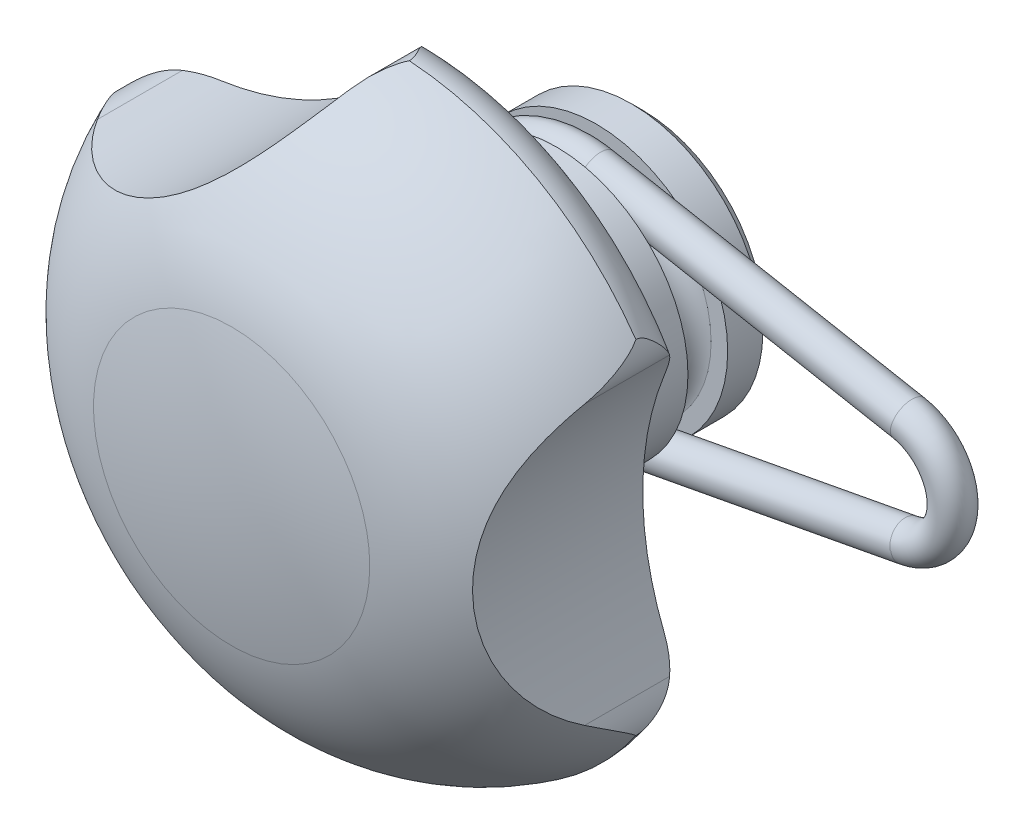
ISO-10303-21;
HEADER;
FILE_DESCRIPTION(('STEP AP214'),'2;1');
FILE_NAME('part.step','',(''),(''),'','','');
FILE_SCHEMA(('AUTOMOTIVE_DESIGN { 1 0 10303 214 1 1 1 1 }'));
ENDSEC;
DATA;
#1=APPLICATION_CONTEXT('core data for automotive mechanical design processes');
#2=APPLICATION_PROTOCOL_DEFINITION('international standard','automotive_design',2000,#1);
#3=PRODUCT_CONTEXT('',#1,'mechanical');
#4=PRODUCT('Part','Part','',(#3));
#5=PRODUCT_RELATED_PRODUCT_CATEGORY('part','',(#4));
#6=PRODUCT_DEFINITION_FORMATION('','',#4);
#7=PRODUCT_DEFINITION_CONTEXT('part definition',#1,'design');
#8=PRODUCT_DEFINITION('design','',#6,#7);
#9=PRODUCT_DEFINITION_SHAPE('','',#8);
#10=(LENGTH_UNIT() NAMED_UNIT(*) SI_UNIT(.MILLI.,.METRE.));
#11=(NAMED_UNIT(*) PLANE_ANGLE_UNIT() SI_UNIT($,.RADIAN.));
#12=(NAMED_UNIT(*) SI_UNIT($,.STERADIAN.) SOLID_ANGLE_UNIT());
#13=UNCERTAINTY_MEASURE_WITH_UNIT(LENGTH_MEASURE(1.E-05),#10,'distance_accuracy_value','');
#14=(GEOMETRIC_REPRESENTATION_CONTEXT(3) GLOBAL_UNCERTAINTY_ASSIGNED_CONTEXT((#13)) GLOBAL_UNIT_ASSIGNED_CONTEXT((#10,
#11,#12)) REPRESENTATION_CONTEXT('',''));
#15=CARTESIAN_POINT('',(0.,0.,0.));
#16=DIRECTION('',(0.,0.,1.));
#17=DIRECTION('',(1.,0.,0.));
#18=AXIS2_PLACEMENT_3D('',#15,#16,#17);
#19=CARTESIAN_POINT('',(0.,0.,3.83333333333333));
#20=DIRECTION('',(0.,0.,1.));
#21=DIRECTION('',(0.,1.,0.));
#22=AXIS2_PLACEMENT_3D('',#19,#20,#21);
#23=TOROIDAL_SURFACE('',#22,6.30900157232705,1.07566823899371);
#24=CARTESIAN_POINT('',(0.,0.,4.89166666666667));
#25=DIRECTION('',(0.,0.,1.));
#26=DIRECTION('',(0.,1.,0.));
#27=AXIS2_PLACEMENT_3D('',#24,#25,#26);
#28=CIRCLE('',#27,6.11666666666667);
#29=CARTESIAN_POINT('',(0.,6.11666666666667,4.89166666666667));
#30=VERTEX_POINT('',#29);
#31=EDGE_CURVE('E430',#30,#30,#28,.T.);
#32=ORIENTED_EDGE('',*,*,#31,.F.);
#33=EDGE_LOOP('',(#32));
#34=FACE_BOUND('',#33,.T.);
#35=CARTESIAN_POINT('',(0.,0.,2.92745184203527));
#36=DIRECTION('',(0.,0.,-1.));
#37=DIRECTION('',(0.,-1.,0.));
#38=AXIS2_PLACEMENT_3D('',#35,#36,#37);
#39=CIRCLE('',#38,5.72896632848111);
#40=CARTESIAN_POINT('',(1.0567994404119,-5.63065095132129,2.92745184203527));
#41=VERTEX_POINT('',#40);
#42=CARTESIAN_POINT('',(1.0567994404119,5.6306509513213,2.92745184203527));
#43=VERTEX_POINT('',#42);
#44=EDGE_CURVE('E598',#41,#43,#39,.T.);
#45=ORIENTED_EDGE('',*,*,#44,.T.);
#46=CARTESIAN_POINT('',(0.937502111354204,5.6502157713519,4.73825138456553));
#47=CARTESIAN_POINT('',(0.991904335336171,5.64253620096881,4.73909451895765));
#48=CARTESIAN_POINT('',(1.0460934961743,5.63320714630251,4.73939411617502));
#49=CARTESIAN_POINT('',(1.15396344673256,5.61111955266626,4.73878156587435));
#50=CARTESIAN_POINT('',(1.20764169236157,5.59834874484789,4.73786503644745));
#51=CARTESIAN_POINT('',(1.31513781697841,5.5689933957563,4.73465398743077));
#52=CARTESIAN_POINT('',(1.36893453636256,5.55233375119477,4.73233066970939));
#53=CARTESIAN_POINT('',(1.47491444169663,5.51494354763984,4.72579342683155));
#54=CARTESIAN_POINT('',(1.5271001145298,5.49421966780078,4.72158258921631));
#55=CARTESIAN_POINT('',(1.62132688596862,5.45147566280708,4.71116369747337));
#56=CARTESIAN_POINT('',(1.66370991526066,5.43012381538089,4.70535324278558));
#57=CARTESIAN_POINT('',(1.74559253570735,5.38351053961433,4.69068312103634));
#58=CARTESIAN_POINT('',(1.78510198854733,5.35826351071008,4.68183454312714));
#59=CARTESIAN_POINT('',(1.85419503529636,5.30765127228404,4.661238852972));
#60=CARTESIAN_POINT('',(1.88437977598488,5.28286687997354,4.65012202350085));
#61=CARTESIAN_POINT('',(1.94023933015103,5.23071594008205,4.62349525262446));
#62=CARTESIAN_POINT('',(1.96592237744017,5.20335425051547,4.60799347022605));
#63=CARTESIAN_POINT('',(2.01188186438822,5.14717036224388,4.57164023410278));
#64=CARTESIAN_POINT('',(2.03211530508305,5.11833856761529,4.55074864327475));
#65=CARTESIAN_POINT('',(2.06676153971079,5.06151412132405,4.50362455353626));
#66=CARTESIAN_POINT('',(2.08116738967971,5.03352250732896,4.47738573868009));
#67=CARTESIAN_POINT('',(2.10373773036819,4.98329350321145,4.42344790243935));
#68=CARTESIAN_POINT('',(2.11241496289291,4.96076191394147,4.3962281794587));
#69=CARTESIAN_POINT('',(2.12681478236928,4.91882092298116,4.33878825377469));
#70=CARTESIAN_POINT('',(2.13253690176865,4.89941201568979,4.30856757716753));
#71=CARTESIAN_POINT('',(2.14264434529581,4.86139615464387,4.24063094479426));
#72=CARTESIAN_POINT('',(2.14665864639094,4.84343803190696,4.20249700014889));
#73=CARTESIAN_POINT('',(2.15285810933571,4.81297402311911,4.12396816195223));
#74=CARTESIAN_POINT('',(2.15504219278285,4.80047135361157,4.08357195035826));
#75=CARTESIAN_POINT('',(2.15845908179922,4.77975905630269,3.99534914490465));
#76=CARTESIAN_POINT('',(2.15950526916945,4.77244859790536,3.94730204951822));
#77=CARTESIAN_POINT('',(2.16050206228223,4.76550633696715,3.85063948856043));
#78=CARTESIAN_POINT('',(2.16045227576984,4.7658772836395,3.80202382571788));
#79=CARTESIAN_POINT('',(2.15920497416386,4.77450245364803,3.70308674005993));
#80=CARTESIAN_POINT('',(2.15795110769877,4.78314366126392,3.65279908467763));
#81=CARTESIAN_POINT('',(2.15361307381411,4.80867959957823,3.55439918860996));
#82=CARTESIAN_POINT('',(2.15052775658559,4.82557951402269,3.50628833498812));
#83=CARTESIAN_POINT('',(2.14130653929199,4.86682092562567,3.4144679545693));
#84=CARTESIAN_POINT('',(2.13521376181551,4.89105540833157,3.37070642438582));
#85=CARTESIAN_POINT('',(2.11799228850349,4.9459523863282,3.28855735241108));
#86=CARTESIAN_POINT('',(2.10687580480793,4.97659919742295,3.25015707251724));
#87=CARTESIAN_POINT('',(2.08122366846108,5.03316913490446,3.18985942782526));
#88=CARTESIAN_POINT('',(2.06842965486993,5.05812336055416,3.16630930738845));
#89=CARTESIAN_POINT('',(2.03822140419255,5.10882604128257,3.12345426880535));
#90=CARTESIAN_POINT('',(2.02081402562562,5.13457326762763,3.10414312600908));
#91=CARTESIAN_POINT('',(1.98140281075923,5.1853204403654,3.06981995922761));
#92=CARTESIAN_POINT('',(1.95940435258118,5.21032122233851,3.05480295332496));
#93=CARTESIAN_POINT('',(1.91148709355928,5.25846843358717,3.02854973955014));
#94=CARTESIAN_POINT('',(1.88556435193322,5.2816129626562,3.01731736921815));
#95=CARTESIAN_POINT('',(1.81514447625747,5.33801442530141,2.99230248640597));
#96=CARTESIAN_POINT('',(1.76848368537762,5.36951362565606,2.98071714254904));
#97=CARTESIAN_POINT('',(1.67066461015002,5.42688579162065,2.96208994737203));
#98=CARTESIAN_POINT('',(1.61947197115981,5.45270949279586,2.95508691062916));
#99=CARTESIAN_POINT('',(1.51656190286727,5.49853178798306,2.94417024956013));
#100=CARTESIAN_POINT('',(1.46493345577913,5.51871008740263,2.94015221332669));
#101=CARTESIAN_POINT('',(1.36014884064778,5.55513974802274,2.93391961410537));
#102=CARTESIAN_POINT('',(1.30699063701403,5.57138557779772,2.93170758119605));
#103=CARTESIAN_POINT('',(1.20136915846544,5.59987404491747,2.92868382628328));
#104=CARTESIAN_POINT('',(1.14893624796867,5.61222610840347,2.92783042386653));
#105=CARTESIAN_POINT('',(1.04357010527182,5.6336429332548,2.92728470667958));
#106=CARTESIAN_POINT('',(0.990639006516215,5.6427180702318,2.92758869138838));
#107=CARTESIAN_POINT('',(0.937502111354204,5.65021577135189,2.92841528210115));
#108=B_SPLINE_CURVE_WITH_KNOTS('',3,(#46,#47,#48,#49,#50,#51,#52,#53,#54,#55,#56,#57,#58,#59,
#60,#61,#62,#63,#64,#65,#66,#67,#68,#69,#70,#71,#72,#73,#74,#75,#76,#77,#78,#79,#80,#81,#82,#83,
#84,#85,#86,#87,#88,#89,#90,#91,#92,#93,#94,#95,#96,#97,#98,#99,#100,#101,#102,#103,#104,#105,
#106,#107),.UNSPECIFIED.,.F.,.F.,(4,2,2,2,2,2,2,2,2,2,2,2,2,2,2,2,2,2,2,2,2,2,2,2,2,2,2,2,2,2,
4),(0.,0.16483244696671,0.330260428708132,0.499195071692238,0.667854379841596,0.811045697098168,
0.953719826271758,1.07508517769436,1.19622617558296,1.31829672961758,1.4405123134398,
1.54926415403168,1.65803319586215,1.78456874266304,1.91117879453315,2.05636749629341,
2.20160816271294,2.35399513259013,2.50647787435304,2.65683510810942,2.80682878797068,
2.91619580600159,3.02540113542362,3.13447924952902,3.24366763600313,3.41510780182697,
3.58798197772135,3.75448059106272,3.92121205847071,4.08272248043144,4.24371693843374),.UNSPECIFIED.);
#109=CARTESIAN_POINT('',(1.0567994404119,5.6306509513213,4.7392148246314));
#110=VERTEX_POINT('',#109);
#111=EDGE_CURVE('E222',#110,#43,#108,.T.);
#112=ORIENTED_EDGE('',*,*,#111,.F.);
#113=CARTESIAN_POINT('',(0.,0.,4.7392148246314));
#114=DIRECTION('',(0.,0.,1.));
#115=DIRECTION('',(0.,1.,0.));
#116=AXIS2_PLACEMENT_3D('',#113,#114,#115);
#117=CIRCLE('',#116,5.72896632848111);
#118=CARTESIAN_POINT('',(1.0567994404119,-5.6306509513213,4.73921482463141));
#119=VERTEX_POINT('',#118);
#120=EDGE_CURVE('E133',#110,#119,#117,.T.);
#121=ORIENTED_EDGE('',*,*,#120,.T.);
#122=CARTESIAN_POINT('',(0.937502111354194,-5.6502157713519,2.92841528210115));
#123=CARTESIAN_POINT('',(0.991904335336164,-5.64253620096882,2.92757214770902));
#124=CARTESIAN_POINT('',(1.04609349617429,-5.63320714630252,2.92727255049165));
#125=CARTESIAN_POINT('',(1.15396344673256,-5.61111955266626,2.92788510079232));
#126=CARTESIAN_POINT('',(1.20764169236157,-5.59834874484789,2.92880163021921));
#127=CARTESIAN_POINT('',(1.31513781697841,-5.5689933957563,2.9320126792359));
#128=CARTESIAN_POINT('',(1.36893453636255,-5.55233375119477,2.93433599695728));
#129=CARTESIAN_POINT('',(1.47491444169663,-5.51494354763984,2.94087323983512));
#130=CARTESIAN_POINT('',(1.52710011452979,-5.49421966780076,2.94508407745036));
#131=CARTESIAN_POINT('',(1.62132688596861,-5.45147566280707,2.95550296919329));
#132=CARTESIAN_POINT('',(1.66370991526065,-5.43012381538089,2.96131342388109));
#133=CARTESIAN_POINT('',(1.74559253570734,-5.38351053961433,2.97598354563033));
#134=CARTESIAN_POINT('',(1.78510198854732,-5.35826351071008,2.98483212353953));
#135=CARTESIAN_POINT('',(1.85419503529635,-5.30765127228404,3.00542781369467));
#136=CARTESIAN_POINT('',(1.88437977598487,-5.28286687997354,3.01654464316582));
#137=CARTESIAN_POINT('',(1.94023933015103,-5.23071594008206,3.0431714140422));
#138=CARTESIAN_POINT('',(1.96592237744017,-5.20335425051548,3.05867319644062));
#139=CARTESIAN_POINT('',(2.01188186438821,-5.14717036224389,3.09502643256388));
#140=CARTESIAN_POINT('',(2.03211530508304,-5.1183385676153,3.11591802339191));
#141=CARTESIAN_POINT('',(2.06676153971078,-5.06151412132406,3.1630421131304));
#142=CARTESIAN_POINT('',(2.08116738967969,-5.03352250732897,3.18928092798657));
#143=CARTESIAN_POINT('',(2.10373773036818,-4.98329350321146,3.24321876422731));
#144=CARTESIAN_POINT('',(2.1124149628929,-4.96076191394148,3.27043848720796));
#145=CARTESIAN_POINT('',(2.12681478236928,-4.91882092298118,3.32787841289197));
#146=CARTESIAN_POINT('',(2.13253690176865,-4.8994120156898,3.35809908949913));
#147=CARTESIAN_POINT('',(2.1426443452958,-4.86139615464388,3.4260357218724));
#148=CARTESIAN_POINT('',(2.14665864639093,-4.84343803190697,3.46416966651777));
#149=CARTESIAN_POINT('',(2.15285810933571,-4.81297402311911,3.54269850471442));
#150=CARTESIAN_POINT('',(2.15504219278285,-4.80047135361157,3.58309471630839));
#151=CARTESIAN_POINT('',(2.15845908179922,-4.77975905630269,3.671317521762));
#152=CARTESIAN_POINT('',(2.15950526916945,-4.77244859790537,3.71936461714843));
#153=CARTESIAN_POINT('',(2.16050206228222,-4.76550633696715,3.81602717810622));
#154=CARTESIAN_POINT('',(2.16045227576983,-4.7658772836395,3.86464284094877));
#155=CARTESIAN_POINT('',(2.15920497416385,-4.77450245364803,3.96357992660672));
#156=CARTESIAN_POINT('',(2.15795110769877,-4.78314366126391,4.01386758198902));
#157=CARTESIAN_POINT('',(2.15361307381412,-4.80867959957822,4.11226747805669));
#158=CARTESIAN_POINT('',(2.15052775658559,-4.82557951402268,4.16037833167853));
#159=CARTESIAN_POINT('',(2.141306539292,-4.86682092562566,4.25219871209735));
#160=CARTESIAN_POINT('',(2.13521376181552,-4.89105540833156,4.29596024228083));
#161=CARTESIAN_POINT('',(2.1179922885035,-4.94595238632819,4.37810931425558));
#162=CARTESIAN_POINT('',(2.10687580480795,-4.97659919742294,4.41650959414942));
#163=CARTESIAN_POINT('',(2.08122366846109,-5.03316913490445,4.47680723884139));
#164=CARTESIAN_POINT('',(2.06842965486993,-5.05812336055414,4.50035735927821));
#165=CARTESIAN_POINT('',(2.03822140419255,-5.10882604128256,4.54321239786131));
#166=CARTESIAN_POINT('',(2.02081402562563,-5.13457326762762,4.56252354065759));
#167=CARTESIAN_POINT('',(1.98140281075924,-5.18532044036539,4.59684670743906));
#168=CARTESIAN_POINT('',(1.9594043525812,-5.2103212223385,4.61186371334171));
#169=CARTESIAN_POINT('',(1.9114870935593,-5.25846843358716,4.63811692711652));
#170=CARTESIAN_POINT('',(1.88556435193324,-5.28161296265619,4.64934929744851));
#171=CARTESIAN_POINT('',(1.8151444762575,-5.3380144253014,4.6743641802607));
#172=CARTESIAN_POINT('',(1.76848368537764,-5.36951362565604,4.68594952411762));
#173=CARTESIAN_POINT('',(1.67066461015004,-5.42688579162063,4.70457671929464));
#174=CARTESIAN_POINT('',(1.61947197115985,-5.45270949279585,4.71157975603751));
#175=CARTESIAN_POINT('',(1.5165619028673,-5.49853178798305,4.72249641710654));
#176=CARTESIAN_POINT('',(1.46493345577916,-5.51871008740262,4.72651445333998));
#177=CARTESIAN_POINT('',(1.3601488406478,-5.55513974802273,4.7327470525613));
#178=CARTESIAN_POINT('',(1.30699063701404,-5.57138557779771,4.73495908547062));
#179=CARTESIAN_POINT('',(1.20136915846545,-5.59987404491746,4.73798284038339));
#180=CARTESIAN_POINT('',(1.14893624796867,-5.61222610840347,4.73883624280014));
#181=CARTESIAN_POINT('',(1.04357010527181,-5.63364293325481,4.73938195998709));
#182=CARTESIAN_POINT('',(0.990639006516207,-5.6427180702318,4.73907797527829));
#183=CARTESIAN_POINT('',(0.937502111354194,-5.6502157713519,4.73825138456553));
#184=B_SPLINE_CURVE_WITH_KNOTS('',3,(#122,#123,#124,#125,#126,#127,#128,#129,#130,#131,#132,
#133,#134,#135,#136,#137,#138,#139,#140,#141,#142,#143,#144,#145,#146,#147,#148,#149,#150,#151,
#152,#153,#154,#155,#156,#157,#158,#159,#160,#161,#162,#163,#164,#165,#166,#167,#168,#169,#170,
#171,#172,#173,#174,#175,#176,#177,#178,#179,#180,#181,#182,#183),.UNSPECIFIED.,.F.,.F.,(4,2,2,
2,2,2,2,2,2,2,2,2,2,2,2,2,2,2,2,2,2,2,2,2,2,2,2,2,2,2,4),(0.,0.164832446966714,
0.330260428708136,0.499195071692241,0.667854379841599,0.811045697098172,0.953719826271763,
1.07508517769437,1.19622617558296,1.31829672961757,1.44051231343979,1.54926415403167,
1.65803319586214,1.78456874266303,1.91117879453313,2.0563674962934,2.20160816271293,
2.35399513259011,2.50647787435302,2.65683510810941,2.80682878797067,2.91619580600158,
3.02540113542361,3.13447924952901,3.24366763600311,3.41510780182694,3.58798197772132,
3.75448059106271,3.92121205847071,4.08272248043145,4.24371693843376),.UNSPECIFIED.);
#185=EDGE_CURVE('E129',#41,#119,#184,.T.);
#186=ORIENTED_EDGE('',*,*,#185,.F.);
#187=EDGE_LOOP('',(#45,#112,#121,#186));
#188=FACE_BOUND('',#187,.T.);
#189=CARTESIAN_POINT('',(0.,0.,2.775));
#190=DIRECTION('',(0.,0.,1.));
#191=DIRECTION('',(0.,1.,0.));
#192=AXIS2_PLACEMENT_3D('',#189,#190,#191);
#193=CIRCLE('',#192,6.11666666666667);
#194=CARTESIAN_POINT('',(0.,6.11666666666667,2.775));
#195=VERTEX_POINT('',#194);
#196=EDGE_CURVE('E433',#195,#195,#193,.T.);
#197=ORIENTED_EDGE('',*,*,#196,.T.);
#198=EDGE_LOOP('',(#197));
#199=FACE_BOUND('',#198,.T.);
#200=ADVANCED_FACE('F14',(#34,#188,#199),#23,.F.);
#201=CARTESIAN_POINT('',(0.,0.,13.8));
#202=DIRECTION('',(0.,0.,1.));
#203=DIRECTION('',(0.,1.,0.));
#204=AXIS2_PLACEMENT_3D('',#201,#202,#203);
#205=TOROIDAL_SURFACE('',#204,13.7,2.3);
#206=CARTESIAN_POINT('',(0.,0.,11.5));
#207=DIRECTION('',(0.,0.,1.));
#208=DIRECTION('',(0.,1.,0.));
#209=AXIS2_PLACEMENT_3D('',#206,#207,#208);
#210=CIRCLE('',#209,13.7);
#211=CARTESIAN_POINT('',(12.3443014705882,5.94207213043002,11.5));
#212=VERTEX_POINT('',#211);
#213=CARTESIAN_POINT('',(-1.02616531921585,13.6615147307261,11.5));
#214=VERTEX_POINT('',#213);
#215=EDGE_CURVE('E418',#212,#214,#210,.T.);
#216=ORIENTED_EDGE('',*,*,#215,.T.);
#217=CARTESIAN_POINT('',(-4.2312462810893,10.5856768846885,13.8002));
#218=CARTESIAN_POINT('',(-4.23136190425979,10.5855971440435,13.7645134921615));
#219=CARTESIAN_POINT('',(-4.22849680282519,10.5876625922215,13.7290193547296));
#220=CARTESIAN_POINT('',(-4.21785449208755,10.595358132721,13.6597820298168));
#221=CARTESIAN_POINT('',(-4.21016349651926,10.6009256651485,13.6260191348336));
#222=CARTESIAN_POINT('',(-4.18678441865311,10.6178988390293,13.5464650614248));
#223=CARTESIAN_POINT('',(-4.16909163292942,10.6307763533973,13.5016059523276));
#224=CARTESIAN_POINT('',(-4.12852073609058,10.6604761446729,13.4153712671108));
#225=CARTESIAN_POINT('',(-4.10559790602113,10.6773324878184,13.3740302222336));
#226=CARTESIAN_POINT('',(-4.04666666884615,10.7209526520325,13.2785135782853));
#227=CARTESIAN_POINT('',(-4.00911114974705,10.7489691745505,13.2258931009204));
#228=CARTESIAN_POINT('',(-3.93052934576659,10.8081937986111,13.1251760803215));
#229=CARTESIAN_POINT('',(-3.88949526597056,10.839409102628,13.0770902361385));
#230=CARTESIAN_POINT('',(-3.80517638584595,10.9042399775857,12.984150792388));
#231=CARTESIAN_POINT('',(-3.76188172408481,10.9378663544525,12.9393138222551));
#232=CARTESIAN_POINT('',(-3.67403497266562,11.0068535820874,12.8524323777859));
#233=CARTESIAN_POINT('',(-3.62948417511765,11.0422126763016,12.8103851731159));
#234=CARTESIAN_POINT('',(-3.52252666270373,11.1280656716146,12.7130959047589));
#235=CARTESIAN_POINT('',(-3.45973381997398,11.1792298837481,12.6588714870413));
#236=CARTESIAN_POINT('',(-3.33317895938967,11.2840066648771,12.554015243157));
#237=CARTESIAN_POINT('',(-3.26941666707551,11.3376199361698,12.5033844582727));
#238=CARTESIAN_POINT('',(-3.14122519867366,11.4471690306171,12.4053317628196));
#239=CARTESIAN_POINT('',(-3.07679524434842,11.5031078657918,12.3579142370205));
#240=CARTESIAN_POINT('',(-2.94759334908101,11.617144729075,12.2662413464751));
#241=CARTESIAN_POINT('',(-2.8828213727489,11.6752429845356,12.2219863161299));
#242=CARTESIAN_POINT('',(-2.68861370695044,11.8523751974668,12.0942039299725));
#243=CARTESIAN_POINT('',(-2.55891327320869,11.9745642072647,12.0153760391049));
#244=CARTESIAN_POINT('',(-2.29998013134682,12.2270681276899,11.8716165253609));
#245=CARTESIAN_POINT('',(-2.17074706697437,12.3573740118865,11.806669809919));
#246=CARTESIAN_POINT('',(-1.95859353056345,12.5789951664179,11.7128700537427));
#247=CARTESIAN_POINT('',(-1.87530702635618,12.6679801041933,11.679342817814));
#248=CARTESIAN_POINT('',(-1.70957238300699,12.8492173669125,11.6199743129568));
#249=CARTESIAN_POINT('',(-1.62712434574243,12.941470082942,11.5941339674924));
#250=CARTESIAN_POINT('',(-1.38175277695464,13.2226477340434,11.5296934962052));
#251=CARTESIAN_POINT('',(-1.22043624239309,13.4163723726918,11.5040051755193));
#252=CARTESIAN_POINT('',(-0.947030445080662,13.7611090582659,11.4977699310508));
#253=CARTESIAN_POINT('',(-0.832920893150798,13.9103429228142,11.5073408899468));
#254=CARTESIAN_POINT('',(-0.612318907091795,14.2095373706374,11.5553736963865));
#255=CARTESIAN_POINT('',(-0.505801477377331,14.3594936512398,11.5937354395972));
#256=CARTESIAN_POINT('',(-0.360458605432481,14.5714184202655,11.6721960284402));
#257=CARTESIAN_POINT('',(-0.317273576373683,14.6354106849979,11.6991674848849));
#258=CARTESIAN_POINT('',(-0.233222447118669,14.761859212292,11.7595405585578));
#259=CARTESIAN_POINT('',(-0.192355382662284,14.8243161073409,11.7929394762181));
#260=CARTESIAN_POINT('',(-0.112862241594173,14.9476076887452,11.8666856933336));
#261=CARTESIAN_POINT('',(-0.0742621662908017,15.0084203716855,11.9070981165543));
#262=CARTESIAN_POINT('',(-1.52723480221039E-05,15.1270494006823,11.9946990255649));
#263=CARTESIAN_POINT('',(0.0356271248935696,15.1848612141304,12.041897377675));
#264=CARTESIAN_POINT('',(0.0695976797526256,15.2407181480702,12.092458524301));
#265=B_SPLINE_CURVE_WITH_KNOTS('',3,(#217,#218,#219,#220,#221,#222,#223,#224,#225,#226,#227,
#228,#229,#230,#231,#232,#233,#234,#235,#236,#237,#238,#239,#240,#241,#242,#243,#244,#245,#246,
#247,#248,#249,#250,#251,#252,#253,#254,#255,#256,#257,#258,#259,#260,#261,#262,#263,#264),
.UNSPECIFIED.,.F.,.F.,(4,2,2,2,2,2,2,2,2,2,2,2,2,2,2,2,2,2,2,2,2,2,2,4),(0.,0.106574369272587,
0.211296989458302,0.360183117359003,0.510393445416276,0.721235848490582,0.93256388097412,
1.14490667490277,1.35703848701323,1.64932679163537,1.94169944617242,2.23446335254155,
2.52725817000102,3.11115470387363,3.69441311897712,4.07336840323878,4.45236919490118,
5.20872268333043,5.77122667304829,6.33178386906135,6.5768731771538,6.82185977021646,
7.06925646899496,7.31701657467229),.UNSPECIFIED.);
#266=CARTESIAN_POINT('',(0.0694760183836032,15.2405181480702,12.0922775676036));
#267=VERTEX_POINT('',#266);
#268=EDGE_CURVE('E516',#214,#267,#265,.T.);
#269=ORIENTED_EDGE('',*,*,#268,.T.);
#270=CARTESIAN_POINT('',(1.06252832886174,15.9646808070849,13.8002));
#271=CARTESIAN_POINT('',(1.06257808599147,15.9646847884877,13.7734731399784));
#272=CARTESIAN_POINT('',(1.06102197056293,15.9643189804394,13.7467859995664));
#273=CARTESIAN_POINT('',(1.05505972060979,15.9628718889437,13.6938668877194));
#274=CARTESIAN_POINT('',(1.05066636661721,15.9617938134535,13.6676334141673));
#275=CARTESIAN_POINT('',(1.03397882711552,15.9575810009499,13.5908885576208));
#276=CARTESIAN_POINT('',(1.0181480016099,15.953465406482,13.5412098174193));
#277=CARTESIAN_POINT('',(0.979192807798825,15.9423997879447,13.441102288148));
#278=CARTESIAN_POINT('',(0.955621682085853,15.935265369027,13.3908817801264));
#279=CARTESIAN_POINT('',(0.904682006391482,15.9182779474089,13.2928418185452));
#280=CARTESIAN_POINT('',(0.877307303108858,15.9084205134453,13.2450264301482));
#281=CARTESIAN_POINT('',(0.820030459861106,15.885810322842,13.1504830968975));
#282=CARTESIAN_POINT('',(0.790092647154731,15.8730101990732,13.1037885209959));
#283=CARTESIAN_POINT('',(0.729190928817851,15.8445834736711,13.01194972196));
#284=CARTESIAN_POINT('',(0.698226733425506,15.8289560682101,12.9668059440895));
#285=CARTESIAN_POINT('',(0.62214232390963,15.7872295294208,12.8580561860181));
#286=CARTESIAN_POINT('',(0.576846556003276,15.7595630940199,12.7951614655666));
#287=CARTESIAN_POINT('',(0.487059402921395,15.6980447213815,12.6718739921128));
#288=CARTESIAN_POINT('',(0.442568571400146,15.6641886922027,12.6114829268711));
#289=CARTESIAN_POINT('',(0.31277786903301,15.55362573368,12.4352086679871));
#290=CARTESIAN_POINT('',(0.230150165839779,15.4674078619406,12.3228560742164));
#291=CARTESIAN_POINT('',(0.140674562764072,15.3479560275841,12.1959383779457));
#292=CARTESIAN_POINT('',(0.125888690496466,15.3272189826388,12.174764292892));
#293=CARTESIAN_POINT('',(0.0970487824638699,15.2846151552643,12.1329862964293));
#294=CARTESIAN_POINT('',(0.0829958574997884,15.2627467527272,12.1123832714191));
#295=CARTESIAN_POINT('',(0.0693543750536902,15.2403181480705,12.0920966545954));
#296=B_SPLINE_CURVE_WITH_KNOTS('',3,(#270,#271,#272,#273,#274,#275,#276,#277,#278,#279,#280,
#281,#282,#283,#284,#285,#286,#287,#288,#289,#290,#291,#292,#293,#294,#295),.UNSPECIFIED.,.F.,
.F.,(4,2,2,2,2,2,2,2,2,2,2,2,4),(0.,0.0800664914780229,0.159774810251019,0.315888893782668,
0.483358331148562,0.651101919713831,0.821762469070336,0.992471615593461,1.23904671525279,
1.48578541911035,1.97398738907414,2.0733311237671,2.17282128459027),.UNSPECIFIED.);
#297=CARTESIAN_POINT('',(1.06252835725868,15.9646808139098,13.8000000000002));
#298=VERTEX_POINT('',#297);
#299=EDGE_CURVE('E544',#298,#267,#296,.T.);
#300=ORIENTED_EDGE('',*,*,#299,.F.);
#301=CARTESIAN_POINT('',(0.,0.,13.8));
#302=DIRECTION('',(0.,0.,1.));
#303=DIRECTION('',(0.,1.,0.));
#304=AXIS2_PLACEMENT_3D('',#301,#302,#303);
#305=CIRCLE('',#304,16.);
#306=CARTESIAN_POINT('',(13.1344647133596,9.13705842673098,13.800000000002));
#307=VERTEX_POINT('',#306);
#308=EDGE_CURVE('E414',#307,#298,#305,.T.);
#309=ORIENTED_EDGE('',*,*,#308,.F.);
#310=CARTESIAN_POINT('',(13.0216343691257,7.41444188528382,11.8921434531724));
#311=CARTESIAN_POINT('',(13.0586895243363,7.48529623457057,11.9374518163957));
#312=CARTESIAN_POINT('',(13.0910093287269,7.55675846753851,11.9854412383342));
#313=CARTESIAN_POINT('',(13.1467751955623,7.69978934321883,12.0858817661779));
#314=CARTESIAN_POINT('',(13.1702393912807,7.7713574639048,12.1383234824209));
#315=CARTESIAN_POINT('',(13.2089469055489,7.91345540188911,12.2467057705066));
#316=CARTESIAN_POINT('',(13.2242283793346,7.98398851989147,12.3026287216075));
#317=CARTESIAN_POINT('',(13.2474156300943,8.12363166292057,12.4177243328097));
#318=CARTESIAN_POINT('',(13.2553185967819,8.19274113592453,12.4768982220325));
#319=CARTESIAN_POINT('',(13.2637237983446,8.31827476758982,12.5888480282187));
#320=CARTESIAN_POINT('',(13.2651783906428,8.37501334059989,12.6412056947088));
#321=CARTESIAN_POINT('',(13.26374328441,8.48641717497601,12.7480333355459));
#322=CARTESIAN_POINT('',(13.2608533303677,8.54108231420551,12.8025034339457));
#323=CARTESIAN_POINT('',(13.2512690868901,8.64763631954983,12.9137216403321));
#324=CARTESIAN_POINT('',(13.2445765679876,8.69952646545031,12.9704686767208));
#325=CARTESIAN_POINT('',(13.228124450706,8.79950082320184,13.0867683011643));
#326=CARTESIAN_POINT('',(13.2183672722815,8.84758800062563,13.1463186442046));
#327=CARTESIAN_POINT('',(13.1997649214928,8.92650825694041,13.253839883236));
#328=CARTESIAN_POINT('',(13.1913135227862,8.95862867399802,13.3009287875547));
#329=CARTESIAN_POINT('',(13.1744037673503,9.0179106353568,13.3981979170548));
#330=CARTESIAN_POINT('',(13.165945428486,9.04507759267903,13.4483746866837));
#331=CARTESIAN_POINT('',(13.1531088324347,9.0842218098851,13.537042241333));
#332=CARTESIAN_POINT('',(13.148268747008,9.09830988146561,13.574505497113));
#333=CARTESIAN_POINT('',(13.1404780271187,9.12053380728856,13.6512842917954));
#334=CARTESIAN_POINT('',(13.1375183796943,9.12869808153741,13.6905900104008));
#335=CARTESIAN_POINT('',(13.134934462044,9.13577171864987,13.7535116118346));
#336=CARTESIAN_POINT('',(13.1344341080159,9.13712036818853,13.7768376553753));
#337=CARTESIAN_POINT('',(13.1344647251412,9.13705839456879,13.8002));
#338=B_SPLINE_CURVE_WITH_KNOTS('',3,(#310,#311,#312,#313,#314,#315,#316,#317,#318,#319,#320,
#321,#322,#323,#324,#325,#326,#327,#328,#329,#330,#331,#332,#333,#334,#335,#336,#337),
.UNSPECIFIED.,.F.,.F.,(4,2,2,2,2,2,2,2,2,2,2,2,2,4),(0.,0.275377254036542,0.550187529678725,
0.823704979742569,1.09732656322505,1.32880648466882,1.5603000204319,1.79168585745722,
2.02288944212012,2.19560059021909,2.36812185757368,2.48872405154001,2.60874374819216,
2.6787316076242),.UNSPECIFIED.);
#339=CARTESIAN_POINT('',(13.0217389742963,7.41464188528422,11.8922713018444));
#340=VERTEX_POINT('',#339);
#341=EDGE_CURVE('E550',#340,#307,#338,.T.);
#342=ORIENTED_EDGE('',*,*,#341,.F.);
#343=CARTESIAN_POINT('',(13.0218435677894,7.41484188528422,11.8923991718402));
#344=CARTESIAN_POINT('',(12.9817362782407,7.33818069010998,11.8433549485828));
#345=CARTESIAN_POINT('',(12.9410212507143,7.25878611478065,11.7992768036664));
#346=CARTESIAN_POINT('',(12.8592155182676,7.09577914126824,11.720796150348));
#347=CARTESIAN_POINT('',(12.8181258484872,7.0121765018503,11.6863723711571));
#348=CARTESIAN_POINT('',(12.7368112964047,6.84287131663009,11.6271555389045));
#349=CARTESIAN_POINT('',(12.6965824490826,6.75721588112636,11.6022318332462));
#350=CARTESIAN_POINT('',(12.6169125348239,6.58351970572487,11.5607934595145));
#351=CARTESIAN_POINT('',(12.5774719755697,6.49547750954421,11.5442840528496));
#352=CARTESIAN_POINT('',(12.4480553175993,6.19927223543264,11.5023496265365));
#353=CARTESIAN_POINT('',(12.360726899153,5.98728247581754,11.4943305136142));
#354=CARTESIAN_POINT('',(12.2369963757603,5.66761857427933,11.508503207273));
#355=CARTESIAN_POINT('',(12.1968374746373,5.56041156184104,11.5176717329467));
#356=CARTESIAN_POINT('',(12.1191157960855,5.34601463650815,11.5439024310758));
#357=CARTESIAN_POINT('',(12.0815523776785,5.23882472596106,11.5609626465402));
#358=CARTESIAN_POINT('',(11.9904881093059,4.96990941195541,11.6127209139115));
#359=CARTESIAN_POINT('',(11.9387212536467,4.80847615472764,11.6519775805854));
#360=CARTESIAN_POINT('',(11.8413146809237,4.48764135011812,11.7441674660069));
#361=CARTESIAN_POINT('',(11.7956788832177,4.32824116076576,11.7971093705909));
#362=CARTESIAN_POINT('',(11.7104210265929,4.0124385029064,11.9146691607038));
#363=CARTESIAN_POINT('',(11.6707915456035,3.85603254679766,11.9792724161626));
#364=CARTESIAN_POINT('',(11.5972296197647,3.54666249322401,12.1188663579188));
#365=CARTESIAN_POINT('',(11.5632943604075,3.39369672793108,12.1938518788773));
#366=CARTESIAN_POINT('',(11.5080051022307,3.12656195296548,12.3353901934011));
#367=CARTESIAN_POINT('',(11.4855512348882,3.01154742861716,12.3999274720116));
#368=CARTESIAN_POINT('',(11.44375820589,2.78462680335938,12.5351746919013));
#369=CARTESIAN_POINT('',(11.4244186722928,2.67272033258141,12.6058838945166));
#370=CARTESIAN_POINT('',(11.3904181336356,2.46318999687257,12.7477822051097));
#371=CARTESIAN_POINT('',(11.3754917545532,2.36519195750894,12.8183446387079));
#372=CARTESIAN_POINT('',(11.3550587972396,2.22264560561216,12.9301310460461));
#373=CARTESIAN_POINT('',(11.3485766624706,2.17589417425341,12.9683630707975));
#374=CARTESIAN_POINT('',(11.3362909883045,2.08443211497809,13.0472835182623));
#375=CARTESIAN_POINT('',(11.3304871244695,2.03972051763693,13.0879707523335));
#376=CARTESIAN_POINT('',(11.3199881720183,1.95623871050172,13.1695502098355));
#377=CARTESIAN_POINT('',(11.3152441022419,1.91727150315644,13.2102325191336));
#378=CARTESIAN_POINT('',(11.306470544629,1.84312475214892,13.295175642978));
#379=CARTESIAN_POINT('',(11.3024419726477,1.80795008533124,13.3394409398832));
#380=CARTESIAN_POINT('',(11.2959908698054,1.75019057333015,13.423272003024));
#381=CARTESIAN_POINT('',(11.293408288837,1.72649097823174,13.4620421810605));
#382=CARTESIAN_POINT('',(11.2889948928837,1.68533152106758,13.5426491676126));
#383=CARTESIAN_POINT('',(11.2871593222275,1.66783228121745,13.5844645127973));
#384=CARTESIAN_POINT('',(11.2849241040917,1.64634053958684,13.6554388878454));
#385=CARTESIAN_POINT('',(11.284245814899,1.63975672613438,13.6837925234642));
#386=CARTESIAN_POINT('',(11.2833223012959,1.63076007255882,13.7414647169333));
#387=CARTESIAN_POINT('',(11.2830818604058,1.62839330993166,13.7707904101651));
#388=CARTESIAN_POINT('',(11.2830882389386,1.6284716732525,13.8002));
#389=B_SPLINE_CURVE_WITH_KNOTS('',3,(#343,#344,#345,#346,#347,#348,#349,#350,#351,#352,#353,
#354,#355,#356,#357,#358,#359,#360,#361,#362,#363,#364,#365,#366,#367,#368,#369,#370,#371,#372,
#373,#374,#375,#376,#377,#378,#379,#380,#381,#382,#383,#384,#385,#386,#387,#388),.UNSPECIFIED.,
.F.,.F.,(4,2,2,2,2,2,2,2,2,2,2,2,2,2,2,2,2,2,2,2,2,2,4),(0.,0.298055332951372,0.595448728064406,
0.888590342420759,1.18191503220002,1.86586553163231,2.21022326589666,2.55449565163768,
3.07575029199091,3.59733658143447,4.11827299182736,4.63895115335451,5.04010723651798,
5.44121537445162,5.80589906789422,5.98805909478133,6.17013162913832,6.33957693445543,
6.50923759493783,6.64542849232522,6.78073826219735,6.86778673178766,6.9557806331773),.UNSPECIFIED.);
#390=EDGE_CURVE('E556',#340,#212,#389,.T.);
#391=ORIENTED_EDGE('',*,*,#390,.T.);
#392=EDGE_LOOP('',(#216,#269,#300,#309,#342,#391));
#393=FACE_BOUND('',#392,.T.);
#394=ADVANCED_FACE('F198',(#393),#205,.T.);
#395=CARTESIAN_POINT('',(-0.0897281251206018,-14.9842776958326,11.8921371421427));
#396=CARTESIAN_POINT('',(-0.0468942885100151,-15.0517959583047,11.9374452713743));
#397=CARTESIAN_POINT('',(-0.00116629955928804,-15.1155172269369,11.9854344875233));
#398=CARTESIAN_POINT('',(0.0948187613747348,-15.23532807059,12.0858746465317));
#399=CARTESIAN_POINT('',(0.145066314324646,-15.2914330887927,12.1383161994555));
#400=CARTESIAN_POINT('',(0.248772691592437,-15.3960044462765,12.2466981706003));
#401=CARTESIAN_POINT('',(0.302215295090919,-15.4445054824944,12.3026209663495));
#402=CARTESIAN_POINT('',(0.411555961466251,-15.534408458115,12.4177162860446));
#403=CARTESIAN_POINT('',(0.467454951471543,-15.5758076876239,12.4768900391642));
#404=CARTESIAN_POINT('',(0.571967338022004,-15.6458540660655,12.5888393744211));
#405=CARTESIAN_POINT('',(0.620376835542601,-15.6754832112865,12.6411966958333));
#406=CARTESIAN_POINT('',(0.717572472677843,-15.7299426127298,12.7480236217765));
#407=CARTESIAN_POINT('',(0.766358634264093,-15.7547725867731,12.8024933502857));
#408=CARTESIAN_POINT('',(0.863428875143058,-15.7997497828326,12.913710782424));
#409=CARTESIAN_POINT('',(0.911713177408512,-15.8198991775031,12.9704574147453));
#410=CARTESIAN_POINT('',(1.00651941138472,-15.8556388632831,13.0867561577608));
#411=CARTESIAN_POINT('',(1.05304270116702,-15.8712327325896,13.1463060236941));
#412=CARTESIAN_POINT('',(1.13069170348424,-15.8945834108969,13.2538272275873));
#413=CARTESIAN_POINT('',(1.1627352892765,-15.9033248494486,13.3009166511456));
#414=CARTESIAN_POINT('',(1.22253151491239,-15.9183221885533,13.3981868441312));
#415=CARTESIAN_POINT('',(1.25028883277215,-15.9245808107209,13.4483641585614));
#416=CARTESIAN_POINT('',(1.29060847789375,-15.9330364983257,13.5370325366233));
#417=CARTESIAN_POINT('',(1.30522973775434,-15.9358890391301,13.5744960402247));
#418=CARTESIAN_POINT('',(1.32837279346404,-15.9402543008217,13.6512754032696));
#419=CARTESIAN_POINT('',(1.33692370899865,-15.9417734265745,13.6905814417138));
#420=CARTESIAN_POINT('',(1.34434283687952,-15.9430727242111,13.7535061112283));
#421=CARTESIAN_POINT('',(1.34576131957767,-15.9433137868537,13.7768348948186));
#422=CARTESIAN_POINT('',(1.34569232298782,-15.9433093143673,13.8002));
#423=B_SPLINE_CURVE_WITH_KNOTS('',3,(#395,#396,#397,#398,#399,#400,#401,#402,#403,#404,#405,
#406,#407,#408,#409,#410,#411,#412,#413,#414,#415,#416,#417,#418,#419,#420,#421,#422),
.UNSPECIFIED.,.F.,.F.,(4,2,2,2,2,2,2,2,2,2,2,2,2,4),(0.,0.275377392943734,0.550187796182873,
0.823705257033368,1.0973268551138,1.32880576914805,1.56029828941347,1.79168313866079,
2.02288575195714,2.19559965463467,2.36812370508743,2.48872727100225,2.60874831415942,
2.67874440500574),.UNSPECIFIED.);
#424=CARTESIAN_POINT('',(-0.0896012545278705,-14.9844776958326,11.892271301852));
#425=VERTEX_POINT('',#424);
#426=CARTESIAN_POINT('',(1.34569235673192,-15.9433093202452,13.800000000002));
#427=VERTEX_POINT('',#426);
#428=EDGE_CURVE('E405',#425,#427,#423,.T.);
#429=ORIENTED_EDGE('',*,*,#428,.F.);
#430=CARTESIAN_POINT('',(-0.0894743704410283,-14.9846776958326,11.8924054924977));
#431=CARTESIAN_POINT('',(-0.135811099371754,-14.911613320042,11.8433608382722));
#432=CARTESIAN_POINT('',(-0.184211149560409,-14.8366559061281,11.7992822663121));
#433=CARTESIAN_POINT('',(-0.284476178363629,-14.6843067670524,11.7208007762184));
#434=CARTESIAN_POINT('',(-0.336333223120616,-14.6069208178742,11.6863765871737));
#435=CARTESIAN_POINT('',(-0.442298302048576,-14.4518478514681,11.6271589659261));
#436=CARTESIAN_POINT('',(-0.496363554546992,-14.3741809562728,11.602234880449));
#437=CARTESIAN_POINT('',(-0.60695370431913,-14.2183367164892,11.5607957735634));
#438=CARTESIAN_POINT('',(-0.663480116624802,-14.1401590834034,11.5442860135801));
#439=CARTESIAN_POINT('',(-0.855292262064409,-13.8799790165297,11.5023505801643));
#440=CARTESIAN_POINT('',(-0.995215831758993,-13.6983561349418,11.4943306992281));
#441=CARTESIAN_POINT('',(-1.2101865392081,-13.4313712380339,11.5085021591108));
#442=CARTESIAN_POINT('',(-1.28295072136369,-13.3429893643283,11.517670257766));
#443=CARTESIAN_POINT('',(-1.42976234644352,-13.1684824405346,11.5439000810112));
#444=CARTESIAN_POINT('',(-1.50380946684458,-13.0823568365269,11.56095984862));
#445=CARTESIAN_POINT('',(-1.69116386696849,-12.8690358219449,11.6127169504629));
#446=CARTESIAN_POINT('',(-1.8050851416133,-12.7434881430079,11.6519728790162));
#447=CARTESIAN_POINT('',(-2.03423176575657,-12.4987148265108,11.7441612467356));
#448=CARTESIAN_POINT('',(-2.14945789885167,-12.3794932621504,11.7971023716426));
#449=CARTESIAN_POINT('',(-2.38032096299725,-12.1477569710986,11.9146605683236));
#450=CARTESIAN_POINT('',(-2.49595720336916,-12.0352340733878,11.9792630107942));
#451=CARTESIAN_POINT('',(-2.72709749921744,-11.8168429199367,12.1188552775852));
#452=CARTESIAN_POINT('',(-2.84260159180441,-11.7109713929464,12.1938399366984));
#453=CARTESIAN_POINT('',(-3.04630291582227,-11.5295211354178,12.3353775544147));
#454=CARTESIAN_POINT('',(-3.13468242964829,-11.452567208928,12.3999151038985));
#455=CARTESIAN_POINT('',(-3.3103068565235,-11.3029110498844,12.5351629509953));
#456=CARTESIAN_POINT('',(-3.39755190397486,-11.2302083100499,12.6058725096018));
#457=CARTESIAN_POINT('',(-3.56201150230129,-11.0959964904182,12.7477710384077));
#458=CARTESIAN_POINT('',(-3.63941742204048,-11.0340704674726,12.8183332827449));
#459=CARTESIAN_POINT('',(-3.7526502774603,-10.945101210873,12.9301193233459));
#460=CARTESIAN_POINT('',(-3.78989734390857,-10.9161115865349,12.9683512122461));
#461=CARTESIAN_POINT('',(-3.86296343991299,-10.8597403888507,13.0472713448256));
#462=CARTESIAN_POINT('',(-3.89878314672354,-10.8323580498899,13.0879583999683));
#463=CARTESIAN_POINT('',(-3.96583203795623,-10.78152394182,13.1695379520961));
#464=CARTESIAN_POINT('',(-3.99720730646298,-10.7579312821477,13.2102205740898));
#465=CARTESIAN_POINT('',(-4.05703497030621,-10.7132586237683,13.2951643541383));
#466=CARTESIAN_POINT('',(-4.08548359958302,-10.6921818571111,13.3394299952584));
#467=CARTESIAN_POINT('',(-4.13228077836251,-10.6577141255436,13.4232619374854));
#468=CARTESIAN_POINT('',(-4.15151467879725,-10.6436271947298,13.462032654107));
#469=CARTESIAN_POINT('',(-4.1849545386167,-10.6192243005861,13.5426408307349));
#470=CARTESIAN_POINT('',(-4.19919222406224,-10.6088845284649,13.5844568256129));
#471=CARTESIAN_POINT('',(-4.21668813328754,-10.5962020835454,13.6554329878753));
#472=CARTESIAN_POINT('',(-4.22205116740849,-10.5923224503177,13.6837877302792));
#473=CARTESIAN_POINT('',(-4.22938134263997,-10.5870239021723,13.7414622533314));
#474=CARTESIAN_POINT('',(-4.23131096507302,-10.5856321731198,13.7707891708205));
#475=CARTESIAN_POINT('',(-4.23124628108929,-10.5856768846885,13.8002));
#476=B_SPLINE_CURVE_WITH_KNOTS('',3,(#430,#431,#432,#433,#434,#435,#436,#437,#438,#439,#440,
#441,#442,#443,#444,#445,#446,#447,#448,#449,#450,#451,#452,#453,#454,#455,#456,#457,#458,#459,
#460,#461,#462,#463,#464,#465,#466,#467,#468,#469,#470,#471,#472,#473,#474,#475),.UNSPECIFIED.,
.F.,.F.,(4,2,2,2,2,2,2,2,2,2,2,2,2,2,2,2,2,2,2,2,2,2,4),(0.,0.298055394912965,0.595448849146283,
0.888590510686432,1.18191524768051,1.86586300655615,2.21021934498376,2.55449033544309,
3.07574251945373,3.59732634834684,4.11826033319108,4.63893607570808,5.04009622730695,
5.44120841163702,5.80589297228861,5.98805343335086,6.17012640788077,6.33957429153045,
6.50923756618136,6.64543128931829,6.78074382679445,6.86779585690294,6.95579343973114),.UNSPECIFIED.);
#477=CARTESIAN_POINT('',(-1.0261653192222,-13.661514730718,11.5));
#478=VERTEX_POINT('',#477);
#479=EDGE_CURVE('E398',#425,#478,#476,.T.);
#480=ORIENTED_EDGE('',*,*,#479,.T.);
#481=CARTESIAN_POINT('',(12.344301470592,-5.94207213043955,11.5));
#482=VERTEX_POINT('',#481);
#483=EDGE_CURVE('E424',#478,#482,#210,.T.);
#484=ORIENTED_EDGE('',*,*,#483,.T.);
#485=CARTESIAN_POINT('',(11.2830882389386,-1.6284716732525,13.8002));
#486=CARTESIAN_POINT('',(11.2830769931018,-1.62833167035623,13.7645134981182));
#487=CARTESIAN_POINT('',(11.2834331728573,-1.63184564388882,13.729019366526));
#488=CARTESIAN_POINT('',(11.2847765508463,-1.6449099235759,13.6597820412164));
#489=CARTESIAN_POINT('',(11.2857526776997,-1.65435428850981,13.6260191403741));
#490=CARTESIAN_POINT('',(11.2887623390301,-1.68308775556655,13.5464650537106));
#491=CARTESIAN_POINT('',(11.2910682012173,-1.70484891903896,13.5016059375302));
#492=CARTESIAN_POINT('',(11.2965035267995,-1.75483424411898,13.4153712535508));
#493=CARTESIAN_POINT('',(11.2996401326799,-1.78311416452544,13.3740302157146));
#494=CARTESIAN_POINT('',(11.3079506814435,-1.85596016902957,13.278513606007));
#495=CARTESIAN_POINT('',(11.3134359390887,-1.90249243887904,13.2258931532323));
#496=CARTESIAN_POINT('',(11.3254350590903,-2.0001585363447,13.1251761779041));
#497=CARTESIAN_POINT('',(11.3319512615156,-2.05130271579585,13.077090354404));
#498=CARTESIAN_POINT('',(11.3459370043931,-2.1567404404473,12.9841509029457));
#499=CARTESIAN_POINT('',(11.3534109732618,-2.2110479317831,12.9393139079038));
#500=CARTESIAN_POINT('',(11.369232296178,-2.32161911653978,12.8524324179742));
#501=CARTESIAN_POINT('',(11.3775787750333,-2.37788081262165,12.8103851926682));
#502=CARTESIAN_POINT('',(11.3984508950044,-2.51343524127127,12.7130959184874));
#503=CARTESIAN_POINT('',(11.4113639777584,-2.59339752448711,12.6588715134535));
#504=CARTESIAN_POINT('',(11.4388258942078,-2.75538559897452,12.5540152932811));
#505=CARTESIAN_POINT('',(11.4533751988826,-2.83741197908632,12.50338451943));
#506=CARTESIAN_POINT('',(11.4841517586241,-3.00320357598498,12.4053318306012));
#507=CARTESIAN_POINT('',(11.500381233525,-3.08697097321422,12.3579143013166));
#508=CARTESIAN_POINT('',(11.5345391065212,-3.25588153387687,12.266241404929));
#509=CARTESIAN_POINT('',(11.5524676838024,-3.34102484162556,12.2219863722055));
#510=CARTESIAN_POINT('',(11.6087648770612,-3.59777987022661,12.0942039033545));
#511=CARTESIAN_POINT('',(11.6497334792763,-3.7711983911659,12.0153759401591));
#512=CARTESIAN_POINT('',(11.7389417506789,-4.12169309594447,11.8716164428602));
#513=CARTESIAN_POINT('',(11.7871734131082,-4.29876506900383,11.8066697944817));
#514=CARTESIAN_POINT('',(11.8730265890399,-4.59330742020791,11.7128695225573));
#515=CARTESIAN_POINT('',(11.9084470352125,-4.70992969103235,11.6793418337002));
#516=CARTESIAN_POINT('',(11.9825372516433,-4.94408295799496,11.6199726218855));
#517=CARTESIAN_POINT('',(12.0212074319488,-5.06161406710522,11.5941320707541));
#518=CARTESIAN_POINT('',(12.1420278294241,-5.41469827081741,11.5296922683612));
#519=CARTESIAN_POINT('',(12.2291369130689,-5.65125761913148,11.5040032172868));
#520=CARTESIAN_POINT('',(12.3909797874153,-6.06038716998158,11.4977716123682));
#521=CARTESIAN_POINT('',(12.4631613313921,-6.23381496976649,11.5073436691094));
#522=CARTESIAN_POINT('',(12.6119588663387,-6.57444120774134,11.5553611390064));
#523=CARTESIAN_POINT('',(12.6885596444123,-6.74165809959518,11.5937123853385));
#524=CARTESIAN_POINT('',(12.8085436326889,-6.99256109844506,11.6786355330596));
#525=CARTESIAN_POINT('',(12.8515379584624,-7.08030185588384,11.7139525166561));
#526=CARTESIAN_POINT('',(12.9371860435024,-7.25130260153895,11.7951397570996));
#527=CARTESIAN_POINT('',(12.9798383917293,-7.33454833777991,11.8410413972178));
#528=CARTESIAN_POINT('',(13.0218435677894,-7.41484188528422,11.8923991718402));
#529=B_SPLINE_CURVE_WITH_KNOTS('',3,(#485,#486,#487,#488,#489,#490,#491,#492,#493,#494,#495,
#496,#497,#498,#499,#500,#501,#502,#503,#504,#505,#506,#507,#508,#509,#510,#511,#512,#513,#514,
#515,#516,#517,#518,#519,#520,#521,#522,#523,#524,#525,#526,#527,#528),.UNSPECIFIED.,.F.,.F.,(4,
2,2,2,2,2,2,2,2,2,2,2,2,2,2,2,2,2,2,2,2,4),(0.,0.106574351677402,0.211296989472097,
0.360183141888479,0.510393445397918,0.721235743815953,0.932563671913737,1.14490657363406,
1.35703848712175,1.64932672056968,1.94169930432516,2.23446322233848,2.5272580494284,
3.11115510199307,3.69441311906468,4.07337369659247,4.4523821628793,5.20872271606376,
5.77116947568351,6.33178386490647,6.6428954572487,6.95494162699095),.UNSPECIFIED.);
#530=CARTESIAN_POINT('',(13.0217389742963,-7.41464188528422,11.8922713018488));
#531=VERTEX_POINT('',#530);
#532=EDGE_CURVE('E272',#482,#531,#529,.T.);
#533=ORIENTED_EDGE('',*,*,#532,.T.);
#534=CARTESIAN_POINT('',(13.1344647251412,-9.13705839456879,13.8002));
#535=CARTESIAN_POINT('',(13.1343677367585,-9.13724345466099,13.7599201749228));
#536=CARTESIAN_POINT('',(13.13589394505,-9.13316893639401,13.7199931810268));
#537=CARTESIAN_POINT('',(13.1412209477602,-9.11840647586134,13.6423177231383));
#538=CARTESIAN_POINT('',(13.1449754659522,-9.10785293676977,13.6045416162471));
#539=CARTESIAN_POINT('',(13.1567365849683,-9.07349045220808,13.5071155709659));
#540=CARTESIAN_POINT('',(13.1659217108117,-9.04552367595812,13.4491663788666));
#541=CARTESIAN_POINT('',(13.184880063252,-8.98211203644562,13.3369341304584));
#542=CARTESIAN_POINT('',(13.1946593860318,-8.9465746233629,13.2827085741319));
#543=CARTESIAN_POINT('',(13.2147706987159,-8.86412015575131,13.1676069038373));
#544=CARTESIAN_POINT('',(13.2248750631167,-8.81631142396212,13.1073352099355));
#545=CARTESIAN_POINT('',(13.2420981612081,-8.71668138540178,12.9897120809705));
#546=CARTESIAN_POINT('',(13.2492140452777,-8.66485630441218,12.9323634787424));
#547=CARTESIAN_POINT('',(13.2596546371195,-8.55845970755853,12.8201604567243));
#548=CARTESIAN_POINT('',(13.2629881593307,-8.50389488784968,12.7653005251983));
#549=CARTESIAN_POINT('',(13.2653371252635,-8.39264564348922,12.6577454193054));
#550=CARTESIAN_POINT('',(13.2643543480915,-8.33596210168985,12.6050493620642));
#551=CARTESIAN_POINT('',(13.25417327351,-8.16226466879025,12.449024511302));
#552=CARTESIAN_POINT('',(13.2376175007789,-8.04268850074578,12.3488764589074));
#553=CARTESIAN_POINT('',(13.1815786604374,-7.80090924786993,12.1590454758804));
#554=CARTESIAN_POINT('',(13.1421712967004,-7.67871611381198,12.069329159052));
#555=CARTESIAN_POINT('',(13.0691378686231,-7.50959903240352,11.9540144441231));
#556=CARTESIAN_POINT('',(13.0464425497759,-7.46187050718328,11.9224677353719));
#557=CARTESIAN_POINT('',(13.0216343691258,-7.41444188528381,11.8921434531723));
#558=B_SPLINE_CURVE_WITH_KNOTS('',3,(#534,#535,#536,#537,#538,#539,#540,#541,#542,#543,#544,
#545,#546,#547,#548,#549,#550,#551,#552,#553,#554,#555,#556,#557),.UNSPECIFIED.,.F.,.F.,(4,2,2,
2,2,2,2,2,2,2,2,4),(0.,0.120046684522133,0.237683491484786,0.43160386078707,0.628046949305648,
0.860521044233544,1.0932163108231,1.32536818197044,1.55742437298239,2.02618258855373,
2.49339667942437,2.67789773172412),.UNSPECIFIED.);
#559=CARTESIAN_POINT('',(13.1344647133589,-9.13705842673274,13.8000000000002));
#560=VERTEX_POINT('',#559);
#561=EDGE_CURVE('E265',#560,#531,#558,.T.);
#562=ORIENTED_EDGE('',*,*,#561,.F.);
#563=EDGE_CURVE('E419',#427,#560,#305,.T.);
#564=ORIENTED_EDGE('',*,*,#563,.F.);
#565=EDGE_LOOP('',(#429,#480,#484,#533,#562,#564));
#566=FACE_BOUND('',#565,.T.);
#567=ADVANCED_FACE('F188',(#566),#205,.T.);
#568=CARTESIAN_POINT('',(0.,0.,0.));
#569=DIRECTION('',(0.,0.,1.));
#570=DIRECTION('',(0.,1.,0.));
#571=AXIS2_PLACEMENT_3D('',#568,#569,#570);
#572=PLANE('',#571);
#573=CARTESIAN_POINT('',(0.,0.,0.));
#574=DIRECTION('',(0.,0.,1.));
#575=DIRECTION('',(0.,1.,0.));
#576=AXIS2_PLACEMENT_3D('',#573,#574,#575);
#577=CIRCLE('',#576,5.);
#578=CARTESIAN_POINT('',(0.,5.,0.));
#579=VERTEX_POINT('',#578);
#580=EDGE_CURVE('E304',#579,#579,#577,.T.);
#581=ORIENTED_EDGE('',*,*,#580,.F.);
#582=EDGE_LOOP('',(#581));
#583=FACE_BOUND('',#582,.T.);
#584=CARTESIAN_POINT('',(0.,0.,0.));
#585=DIRECTION('',(0.,0.,-1.));
#586=DIRECTION('',(0.,-1.,0.));
#587=AXIS2_PLACEMENT_3D('',#584,#585,#586);
#588=CIRCLE('',#587,3.);
#589=CARTESIAN_POINT('',(0.,-3.,0.));
#590=VERTEX_POINT('',#589);
#591=EDGE_CURVE('E173',#590,#590,#588,.T.);
#592=ORIENTED_EDGE('',*,*,#591,.F.);
#593=EDGE_LOOP('',(#592));
#594=FACE_BOUND('',#593,.T.);
#595=ADVANCED_FACE('F16',(#583,#594),#572,.F.);
#596=CARTESIAN_POINT('',(0.,0.,23.));
#597=DIRECTION('',(0.,0.,1.));
#598=DIRECTION('',(0.,1.,0.));
#599=AXIS2_PLACEMENT_3D('',#596,#597,#598);
#600=CYLINDRICAL_SURFACE('',#599,5.);
#601=CARTESIAN_POINT('',(0.,0.,0.3));
#602=DIRECTION('',(0.,0.,1.));
#603=DIRECTION('',(0.,1.,0.));
#604=AXIS2_PLACEMENT_3D('',#601,#602,#603);
#605=CIRCLE('',#604,5.);
#606=CARTESIAN_POINT('',(0.,5.,0.3));
#607=VERTEX_POINT('',#606);
#608=EDGE_CURVE('E444',#607,#607,#605,.T.);
#609=ORIENTED_EDGE('',*,*,#608,.F.);
#610=EDGE_LOOP('',(#609));
#611=FACE_BOUND('',#610,.T.);
#612=ORIENTED_EDGE('',*,*,#580,.T.);
#613=EDGE_LOOP('',(#612));
#614=FACE_BOUND('',#613,.T.);
#615=ADVANCED_FACE('F187',(#611,#614),#600,.T.);
#616=CARTESIAN_POINT('',(-5.,0.,0.3));
#617=DIRECTION('',(0.,0.,1.));
#618=DIRECTION('',(0.,1.,0.));
#619=AXIS2_PLACEMENT_3D('',#616,#617,#618);
#620=PLANE('',#619);
#621=CARTESIAN_POINT('',(0.,0.,0.3));
#622=DIRECTION('',(0.,0.,1.));
#623=DIRECTION('',(0.,1.,0.));
#624=AXIS2_PLACEMENT_3D('',#621,#622,#623);
#625=CIRCLE('',#624,6.4);
#626=CARTESIAN_POINT('',(0.,6.4,0.3));
#627=VERTEX_POINT('',#626);
#628=EDGE_CURVE('E442',#627,#627,#625,.T.);
#629=ORIENTED_EDGE('',*,*,#628,.F.);
#630=EDGE_LOOP('',(#629));
#631=FACE_BOUND('',#630,.T.);
#632=ORIENTED_EDGE('',*,*,#608,.T.);
#633=EDGE_LOOP('',(#632));
#634=FACE_BOUND('',#633,.T.);
#635=ADVANCED_FACE('F196',(#631,#634),#620,.F.);
#636=CARTESIAN_POINT('',(0.,0.,0.3));
#637=DIRECTION('',(0.,0.,1.));
#638=DIRECTION('',(0.,1.,0.));
#639=AXIS2_PLACEMENT_3D('',#636,#637,#638);
#640=CONICAL_SURFACE('',#639,6.4,0.785398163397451);
#641=CARTESIAN_POINT('',(0.,0.,0.9));
#642=DIRECTION('',(0.,0.,1.));
#643=DIRECTION('',(0.,1.,0.));
#644=AXIS2_PLACEMENT_3D('',#641,#642,#643);
#645=CIRCLE('',#644,7.);
#646=CARTESIAN_POINT('',(0.,7.,0.9));
#647=VERTEX_POINT('',#646);
#648=EDGE_CURVE('E439',#647,#647,#645,.T.);
#649=ORIENTED_EDGE('',*,*,#648,.F.);
#650=EDGE_LOOP('',(#649));
#651=FACE_BOUND('',#650,.T.);
#652=ORIENTED_EDGE('',*,*,#628,.T.);
#653=EDGE_LOOP('',(#652));
#654=FACE_BOUND('',#653,.T.);
#655=ADVANCED_FACE('F451',(#651,#654),#640,.T.);
#656=CARTESIAN_POINT('',(0.,0.,23.));
#657=DIRECTION('',(0.,0.,1.));
#658=DIRECTION('',(0.,1.,0.));
#659=AXIS2_PLACEMENT_3D('',#656,#657,#658);
#660=CYLINDRICAL_SURFACE('',#659,7.);
#661=CARTESIAN_POINT('',(0.,0.,2.775));
#662=DIRECTION('',(0.,0.,1.));
#663=DIRECTION('',(0.,1.,0.));
#664=AXIS2_PLACEMENT_3D('',#661,#662,#663);
#665=CIRCLE('',#664,7.);
#666=CARTESIAN_POINT('',(0.,7.,2.775));
#667=VERTEX_POINT('',#666);
#668=EDGE_CURVE('E436',#667,#667,#665,.T.);
#669=ORIENTED_EDGE('',*,*,#668,.F.);
#670=EDGE_LOOP('',(#669));
#671=FACE_BOUND('',#670,.T.);
#672=ORIENTED_EDGE('',*,*,#648,.T.);
#673=EDGE_LOOP('',(#672));
#674=FACE_BOUND('',#673,.T.);
#675=ADVANCED_FACE('F458',(#671,#674),#660,.T.);
#676=CARTESIAN_POINT('',(-7.,0.,2.775));
#677=DIRECTION('',(0.,0.,-1.));
#678=DIRECTION('',(0.,-1.,0.));
#679=AXIS2_PLACEMENT_3D('',#676,#677,#678);
#680=PLANE('',#679);
#681=ORIENTED_EDGE('',*,*,#196,.F.);
#682=EDGE_LOOP('',(#681));
#683=FACE_BOUND('',#682,.T.);
#684=ORIENTED_EDGE('',*,*,#668,.T.);
#685=EDGE_LOOP('',(#684));
#686=FACE_BOUND('',#685,.T.);
#687=ADVANCED_FACE('F218',(#683,#686),#680,.F.);
#688=CARTESIAN_POINT('',(-6.11666666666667,0.,4.89166666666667));
#689=DIRECTION('',(0.,0.,1.));
#690=DIRECTION('',(0.,1.,0.));
#691=AXIS2_PLACEMENT_3D('',#688,#689,#690);
#692=PLANE('',#691);
#693=CARTESIAN_POINT('',(0.,0.,4.89166666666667));
#694=DIRECTION('',(0.,0.,1.));
#695=DIRECTION('',(0.,1.,0.));
#696=AXIS2_PLACEMENT_3D('',#693,#694,#695);
#697=CIRCLE('',#696,7.);
#698=CARTESIAN_POINT('',(0.,7.,4.89166666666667));
#699=VERTEX_POINT('',#698);
#700=EDGE_CURVE('E427',#699,#699,#697,.T.);
#701=ORIENTED_EDGE('',*,*,#700,.F.);
#702=EDGE_LOOP('',(#701));
#703=FACE_BOUND('',#702,.T.);
#704=ORIENTED_EDGE('',*,*,#31,.T.);
#705=EDGE_LOOP('',(#704));
#706=FACE_BOUND('',#705,.T.);
#707=ADVANCED_FACE('F216',(#703,#706),#692,.F.);
#708=CARTESIAN_POINT('',(0.,0.,23.));
#709=DIRECTION('',(0.,0.,1.));
#710=DIRECTION('',(0.,1.,0.));
#711=AXIS2_PLACEMENT_3D('',#708,#709,#710);
#712=CYLINDRICAL_SURFACE('',#711,7.);
#713=CARTESIAN_POINT('',(0.,0.,11.5));
#714=DIRECTION('',(0.,0.,1.));
#715=DIRECTION('',(0.,1.,0.));
#716=AXIS2_PLACEMENT_3D('',#713,#714,#715);
#717=CIRCLE('',#716,7.);
#718=CARTESIAN_POINT('',(0.,7.,11.5));
#719=VERTEX_POINT('',#718);
#720=EDGE_CURVE('E423',#719,#719,#717,.T.);
#721=ORIENTED_EDGE('',*,*,#720,.F.);
#722=EDGE_LOOP('',(#721));
#723=FACE_BOUND('',#722,.T.);
#724=ORIENTED_EDGE('',*,*,#700,.T.);
#725=EDGE_LOOP('',(#724));
#726=FACE_BOUND('',#725,.T.);
#727=ADVANCED_FACE('F478',(#723,#726),#712,.T.);
#728=CARTESIAN_POINT('',(-7.,0.,11.5));
#729=DIRECTION('',(0.,0.,1.));
#730=DIRECTION('',(0.,1.,0.));
#731=AXIS2_PLACEMENT_3D('',#728,#729,#730);
#732=PLANE('',#731);
#733=CARTESIAN_POINT('',(-11.318136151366,7.71944260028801,11.5));
#734=VERTEX_POINT('',#733);
#735=CARTESIAN_POINT('',(-11.3181361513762,-7.71944260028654,11.5));
#736=VERTEX_POINT('',#735);
#737=EDGE_CURVE('E420',#734,#736,#210,.T.);
#738=ORIENTED_EDGE('',*,*,#737,.F.);
#739=CARTESIAN_POINT('',(-13.6,23.5558909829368,11.5));
#740=DIRECTION('',(0.,0.,1.));
#741=DIRECTION('',(0.,1.,0.));
#742=AXIS2_PLACEMENT_3D('',#739,#740,#741);
#743=CIRCLE('',#742,16.);
#744=EDGE_CURVE('E507',#214,#734,#743,.F.);
#745=ORIENTED_EDGE('',*,*,#744,.F.);
#746=ORIENTED_EDGE('',*,*,#215,.F.);
#747=CARTESIAN_POINT('',(27.2,0.,11.5));
#748=DIRECTION('',(0.,0.,1.));
#749=DIRECTION('',(0.,1.,0.));
#750=AXIS2_PLACEMENT_3D('',#747,#748,#749);
#751=CIRCLE('',#750,16.);
#752=EDGE_CURVE('E594',#482,#212,#751,.F.);
#753=ORIENTED_EDGE('',*,*,#752,.F.);
#754=ORIENTED_EDGE('',*,*,#483,.F.);
#755=CARTESIAN_POINT('',(-13.6,-23.5558909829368,11.5));
#756=DIRECTION('',(0.,0.,1.));
#757=DIRECTION('',(0.,1.,0.));
#758=AXIS2_PLACEMENT_3D('',#755,#756,#757);
#759=CIRCLE('',#758,16.);
#760=EDGE_CURVE('E391',#736,#478,#759,.F.);
#761=ORIENTED_EDGE('',*,*,#760,.F.);
#762=EDGE_LOOP('',(#738,#745,#746,#753,#754,#761));
#763=FACE_BOUND('',#762,.T.);
#764=ORIENTED_EDGE('',*,*,#720,.T.);
#765=EDGE_LOOP('',(#764));
#766=FACE_BOUND('',#765,.T.);
#767=ADVANCED_FACE('F486',(#763,#766),#732,.F.);
#768=CARTESIAN_POINT('',(-12.9319377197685,7.56984415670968,11.892157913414));
#769=CARTESIAN_POINT('',(-13.0118264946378,7.56650674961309,11.9374668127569));
#770=CARTESIAN_POINT('',(-13.0898740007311,7.55876453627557,11.9854567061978));
#771=CARTESIAN_POINT('',(-13.2416242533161,7.53554214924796,12.0858980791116));
#772=CARTESIAN_POINT('',(-13.3153356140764,7.52007793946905,12.1383401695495));
#773=CARTESIAN_POINT('',(-13.4577487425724,7.48254928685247,12.2467231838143));
#774=CARTESIAN_POINT('',(-13.5264724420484,7.46051623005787,12.3026464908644));
#775=CARTESIAN_POINT('',(-13.6589995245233,7.41077422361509,12.4177427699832));
#776=CARTESIAN_POINT('',(-13.7228010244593,7.38306311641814,12.4769169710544));
#777=CARTESIAN_POINT('',(-13.835718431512,7.32757426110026,12.5888678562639));
#778=CARTESIAN_POINT('',(-13.8855827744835,7.30046402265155,12.6412263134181));
#779=CARTESIAN_POINT('',(-13.9813436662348,7.24351797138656,12.7480555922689));
#780=CARTESIAN_POINT('',(-14.0272399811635,7.21368199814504,12.802526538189));
#781=CARTESIAN_POINT('',(-14.1147259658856,7.15210364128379,12.9137465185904));
#782=CARTESIAN_POINT('',(-14.1563176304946,7.12036215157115,12.9704944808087));
#783=CARTESIAN_POINT('',(-14.2346711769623,7.05612618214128,13.086796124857));
#784=CARTESIAN_POINT('',(-14.2714368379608,7.02363231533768,13.1463475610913));
#785=CARTESIAN_POINT('',(-14.3304802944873,6.96806307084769,13.2538688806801));
#786=CARTESIAN_POINT('',(-14.3540700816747,6.94468489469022,13.3009565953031));
#787=CARTESIAN_POINT('',(-14.3969517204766,6.90040220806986,13.3982232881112));
#788=CARTESIAN_POINT('',(-14.4162482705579,6.8794950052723,13.4483988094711));
#789=CARTESIAN_POINT('',(-14.4437273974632,6.84880852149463,13.5370644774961));
#790=CARTESIAN_POINT('',(-14.4535070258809,6.8375738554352,13.5745271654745));
#791=CARTESIAN_POINT('',(-14.4688562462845,6.81971703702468,13.651304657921));
#792=CARTESIAN_POINT('',(-14.4744459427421,6.81307287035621,13.6906096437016));
#793=CARTESIAN_POINT('',(-14.4792781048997,6.80730048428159,13.753524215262));
#794=CARTESIAN_POINT('',(-14.4801953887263,6.80619345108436,13.776843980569));
#795=CARTESIAN_POINT('',(-14.480157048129,6.8062509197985,13.8002));
#796=B_SPLINE_CURVE_WITH_KNOTS('',3,(#768,#769,#770,#771,#772,#773,#774,#775,#776,#777,#778,
#779,#780,#781,#782,#783,#784,#785,#786,#787,#788,#789,#790,#791,#792,#793,#794,#795),
.UNSPECIFIED.,.F.,.F.,(4,2,2,2,2,2,2,2,2,2,2,2,2,4),(0.,0.275376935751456,0.550186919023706,
0.823704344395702,1.09732589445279,1.32880812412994,1.56030398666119,1.79169208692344,
2.02289789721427,2.19560273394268,2.36811762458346,2.48871667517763,2.60873328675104,
2.67870228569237),.UNSPECIFIED.);
#797=CARTESIAN_POINT('',(-12.9321377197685,7.5698358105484,11.8922713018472));
#798=VERTEX_POINT('',#797);
#799=CARTESIAN_POINT('',(-14.4801570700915,6.8062508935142,13.8000000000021));
#800=VERTEX_POINT('',#799);
#801=EDGE_CURVE('E520',#798,#800,#796,.T.);
#802=ORIENTED_EDGE('',*,*,#801,.F.);
#803=CARTESIAN_POINT('',(-12.9323377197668,7.56982745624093,11.8923847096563));
#804=CARTESIAN_POINT('',(-12.8458930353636,7.57342428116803,11.8433414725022));
#805=CARTESIAN_POINT('',(-12.756777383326,7.5778614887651,11.7992643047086));
#806=CARTESIAN_POINT('',(-12.5747056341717,7.58851948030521,11.7207855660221));
#807=CARTESIAN_POINT('',(-12.4817585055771,7.59473628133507,11.6863627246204));
#808=CARTESIAN_POINT('',(-12.2944781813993,7.60896876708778,11.627147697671));
#809=CARTESIAN_POINT('',(-12.2001838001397,7.61695746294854,11.6022248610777));
#810=CARTESIAN_POINT('',(-12.0099232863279,7.63480974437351,11.5607881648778));
#811=CARTESIAN_POINT('',(-11.9139561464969,7.64467449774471,11.5442795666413));
#812=CARTESIAN_POINT('',(-11.5927242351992,7.68069985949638,11.502347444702));
#813=CARTESIAN_POINT('',(-11.3654694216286,7.71106685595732,11.4943300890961));
#814=CARTESIAN_POINT('',(-11.026764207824,7.76374624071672,11.5085056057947));
#815=CARTESIAN_POINT('',(-10.913839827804,7.78257154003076,11.517675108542));
#816=CARTESIAN_POINT('',(-10.689304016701,7.82246192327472,11.5439078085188));
#817=CARTESIAN_POINT('',(-10.5776922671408,7.843526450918,11.5609690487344));
#818=CARTESIAN_POINT('',(-10.2992703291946,7.89912133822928,11.6127299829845));
#819=CARTESIAN_POINT('',(-10.1335801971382,7.93500732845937,11.6519883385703));
#820=CARTESIAN_POINT('',(-9.80702317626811,8.01106975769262,11.744181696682));
#821=CARTESIAN_POINT('',(-9.64615942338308,8.05124891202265,11.7971253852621));
#822=CARTESIAN_POINT('',(-9.33003507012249,8.1353164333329,11.9146888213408));
#823=CARTESIAN_POINT('',(-9.17476773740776,8.1792001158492,11.979293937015));
#824=CARTESIAN_POINT('',(-8.87006249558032,8.27018033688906,12.1188917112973));
#825=CARTESIAN_POINT('',(-8.72062173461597,8.31727527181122,12.1938792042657));
#826=CARTESIAN_POINT('',(-8.46163403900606,8.40296096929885,12.3354191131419));
#827=CARTESIAN_POINT('',(-8.35080475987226,8.44102192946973,12.39995577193));
#828=CARTESIAN_POINT('',(-8.13339541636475,8.51828693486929,12.5352015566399));
#829=CARTESIAN_POINT('',(-8.02681484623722,8.55749084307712,12.6059099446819));
#830=CARTESIAN_POINT('',(-7.82836005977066,8.63280966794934,12.747807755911));
#831=CARTESIAN_POINT('',(-7.73602919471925,8.6688818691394,12.8183706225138));
#832=CARTESIAN_POINT('',(-7.60236583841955,8.72245916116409,12.9301578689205));
#833=CARTESIAN_POINT('',(-7.55863750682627,8.7402210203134,12.9683902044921));
#834=CARTESIAN_POINT('',(-7.47328765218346,8.77531194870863,13.0473113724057));
#835=CARTESIAN_POINT('',(-7.43166512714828,8.79264122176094,13.0879990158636));
#836=CARTESIAN_POINT('',(-7.35412110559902,8.82528874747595,13.1695782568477));
#837=CARTESIAN_POINT('',(-7.31800442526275,8.84066310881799,13.2102598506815));
#838=CARTESIAN_POINT('',(-7.24940865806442,8.87013676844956,13.2952014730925));
#839=CARTESIAN_POINT('',(-7.21693425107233,8.88423442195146,13.3394659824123));
#840=CARTESIAN_POINT('',(-7.16369153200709,8.90752565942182,13.4232950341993));
#841=CARTESIAN_POINT('',(-7.14187773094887,8.91713804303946,13.4620639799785));
#842=CARTESIAN_POINT('',(-7.10402961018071,8.93389404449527,13.5426682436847));
#843=CARTESIAN_POINT('',(-7.08795881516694,8.94105323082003,13.5844821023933));
#844=CARTESIAN_POINT('',(-7.06823171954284,8.94986205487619,13.655452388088));
#845=CARTESIAN_POINT('',(-7.06219193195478,8.95256605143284,13.683803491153));
#846=CARTESIAN_POINT('',(-7.05394039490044,8.95626389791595,13.7414703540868));
#847=CARTESIAN_POINT('',(-7.05177092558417,8.95723885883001,13.7707932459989));
#848=CARTESIAN_POINT('',(-7.05184195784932,8.95720521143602,13.8002));
#849=B_SPLINE_CURVE_WITH_KNOTS('',3,(#803,#804,#805,#806,#807,#808,#809,#810,#811,#812,#813,
#814,#815,#816,#817,#818,#819,#820,#821,#822,#823,#824,#825,#826,#827,#828,#829,#830,#831,#832,
#833,#834,#835,#836,#837,#838,#839,#840,#841,#842,#843,#844,#845,#846,#847,#848),.UNSPECIFIED.,
.F.,.F.,(4,2,2,2,2,2,2,2,2,2,2,2,2,2,2,2,2,2,2,2,2,2,4),(0.,0.298055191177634,0.595448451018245,
0.888589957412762,1.18191453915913,1.86587130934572,2.21023223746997,2.55450781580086,
3.07576807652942,3.59735999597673,4.11830195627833,4.63898565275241,5.04013242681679,
5.44123130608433,5.80591301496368,5.98807204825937,6.17014357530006,6.33958298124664,
6.50923766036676,6.64542209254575,6.78072553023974,6.86776585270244,6.95575133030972),.UNSPECIFIED.);
#850=EDGE_CURVE('E514',#798,#734,#849,.T.);
#851=ORIENTED_EDGE('',*,*,#850,.T.);
#852=ORIENTED_EDGE('',*,*,#737,.T.);
#853=CARTESIAN_POINT('',(-7.05184195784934,-8.957205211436,13.8002));
#854=CARTESIAN_POINT('',(-7.05171508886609,-8.95726547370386,13.7645134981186));
#855=CARTESIAN_POINT('',(-7.05493636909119,-8.95581694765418,13.729019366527));
#856=CARTESIAN_POINT('',(-7.0669220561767,-8.95044820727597,13.6597820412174));
#857=CARTESIAN_POINT('',(-7.07558917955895,-8.94657137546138,13.6260191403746));
#858=CARTESIAN_POINT('',(-7.1019779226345,-8.93481108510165,13.5464650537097));
#859=CARTESIAN_POINT('',(-7.1219765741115,-8.92592743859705,13.5016059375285));
#860=CARTESIAN_POINT('',(-7.16798279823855,-8.90564190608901,13.4153712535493));
#861=CARTESIAN_POINT('',(-7.19404223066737,-8.89421832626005,13.3740302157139));
#862=CARTESIAN_POINT('',(-7.26128399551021,-8.86499247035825,13.2785136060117));
#863=CARTESIAN_POINT('',(-7.30432475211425,-8.84647670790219,13.2258931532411));
#864=CARTESIAN_POINT('',(-7.39490563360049,-8.80803520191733,13.1251761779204));
#865=CARTESIAN_POINT('',(-7.44245589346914,-8.78810630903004,13.0770903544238));
#866=CARTESIAN_POINT('',(-7.54076051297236,-8.74749945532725,12.9841509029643));
#867=CARTESIAN_POINT('',(-7.59152916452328,-8.72681835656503,12.9393139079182));
#868=CARTESIAN_POINT('',(-7.69519728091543,-8.68523443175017,12.852432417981));
#869=CARTESIAN_POINT('',(-7.74809457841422,-8.66433184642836,12.8103851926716));
#870=CARTESIAN_POINT('',(-7.87592421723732,-8.6146304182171,12.7130959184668));
#871=CARTESIAN_POINT('',(-7.95163012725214,-8.58583233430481,12.6588715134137));
#872=CARTESIAN_POINT('',(-8.1056468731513,-8.5286210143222,12.5540152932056));
#873=CARTESIAN_POINT('',(-8.18395845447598,-8.50020789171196,12.5033845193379));
#874=CARTESIAN_POINT('',(-8.34292646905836,-8.44396537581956,12.4053318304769));
#875=CARTESIAN_POINT('',(-8.42358590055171,-8.41613681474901,12.3579143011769));
#876=CARTESIAN_POINT('',(-8.58694567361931,-8.36126312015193,12.2662414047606));
#877=CARTESIAN_POINT('',(-8.66964622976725,-8.33421806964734,12.2219863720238));
#878=CARTESIAN_POINT('',(-8.92015120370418,-8.25459535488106,12.0942039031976));
#879=CARTESIAN_POINT('',(-9.0908203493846,-8.20336594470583,12.0153759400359));
#880=CARTESIAN_POINT('',(-9.43896180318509,-8.10537522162,11.8716164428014));
#881=CARTESIAN_POINT('',(-9.6164264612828,-8.05860908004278,11.8066697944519));
#882=CARTESIAN_POINT('',(-9.91443420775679,-7.98568893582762,11.7128695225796));
#883=CARTESIAN_POINT('',(-10.0331422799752,-7.958052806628,11.6793418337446));
#884=CARTESIAN_POINT('',(-10.2729700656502,-7.90514018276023,11.6199726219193));
#885=CARTESIAN_POINT('',(-10.3940900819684,-7.87986398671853,11.594132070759));
#886=CARTESIAN_POINT('',(-10.7602801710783,-7.8079554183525,11.5296922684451));
#887=CARTESIAN_POINT('',(-11.0087011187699,-7.76511442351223,11.5040032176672));
#888=CARTESIAN_POINT('',(-11.4439391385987,-7.70070968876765,11.4977716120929));
#889=CARTESIAN_POINT('',(-11.6302227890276,-7.67650683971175,11.507343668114));
#890=CARTESIAN_POINT('',(-11.9996125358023,-7.63505616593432,11.5553611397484));
#891=CARTESIAN_POINT('',(-12.182727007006,-7.61778593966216,11.5937123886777));
#892=CARTESIAN_POINT('',(-12.4600027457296,-7.59624398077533,11.6786341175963));
#893=CARTESIAN_POINT('',(-12.5574811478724,-7.58960804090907,11.7139492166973));
#894=CARTESIAN_POINT('',(-12.7483876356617,-7.57828143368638,11.7951316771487));
#895=CARTESIAN_POINT('',(-12.8418026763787,-7.57359666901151,11.8410304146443));
#896=CARTESIAN_POINT('',(-12.9323378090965,-7.56982745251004,11.8923847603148));
#897=B_SPLINE_CURVE_WITH_KNOTS('',3,(#853,#854,#855,#856,#857,#858,#859,#860,#861,#862,#863,
#864,#865,#866,#867,#868,#869,#870,#871,#872,#873,#874,#875,#876,#877,#878,#879,#880,#881,#882,
#883,#884,#885,#886,#887,#888,#889,#890,#891,#892,#893,#894,#895,#896),.UNSPECIFIED.,.F.,.F.,(4,
2,2,2,2,2,2,2,2,2,2,2,2,2,2,2,2,2,2,2,2,4),(0.,0.106574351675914,0.211296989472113,
0.360183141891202,0.510393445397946,0.721235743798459,0.932563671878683,1.14490657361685,
1.35703848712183,1.64932672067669,1.94169930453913,2.23446322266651,2.52725804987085,
3.11115510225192,3.69441311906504,4.07337369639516,4.4523821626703,5.20872271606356,
5.77116947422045,6.33178386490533,6.64288094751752,6.95491244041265),.UNSPECIFIED.);
#898=CARTESIAN_POINT('',(-12.9321378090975,-7.56983580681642,11.8922713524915));
#899=VERTEX_POINT('',#898);
#900=EDGE_CURVE('E383',#736,#899,#897,.T.);
#901=ORIENTED_EDGE('',*,*,#900,.T.);
#902=CARTESIAN_POINT('',(-14.480157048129,-6.80625091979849,13.8002));
#903=CARTESIAN_POINT('',(-14.4802688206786,-6.8060743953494,13.759920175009));
#904=CARTESIAN_POINT('',(-14.4775032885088,-6.80943338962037,13.7199931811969));
#905=CARTESIAN_POINT('',(-14.4673821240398,-6.82142793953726,13.6423177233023));
#906=CARTESIAN_POINT('',(-14.4601197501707,-6.82995621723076,13.6045416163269));
#907=CARTESIAN_POINT('',(-14.4362415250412,-6.85732288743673,13.5071155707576));
#908=CARTESIAN_POINT('',(-14.4166141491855,-6.87926082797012,13.4491663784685));
#909=CARTESIAN_POINT('',(-14.3711772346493,-6.92738506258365,13.3369341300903));
#910=CARTESIAN_POINT('',(-14.3452905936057,-6.95362291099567,13.2827085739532));
#911=CARTESIAN_POINT('',(-14.283938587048,-7.01226705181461,13.167606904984));
#912=CARTESIAN_POINT('',(-14.2475871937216,-7.04492205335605,13.1073352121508));
#913=CARTESIAN_POINT('',(-14.1699166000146,-7.10965271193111,12.98971208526));
#914=CARTESIAN_POINT('',(-14.1285927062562,-7.14172778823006,12.9323634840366));
#915=CARTESIAN_POINT('',(-14.0416708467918,-7.20396790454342,12.8201604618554));
#916=CARTESIAN_POINT('',(-13.9960830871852,-7.23413722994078,12.7653005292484));
#917=CARTESIAN_POINT('',(-13.9009128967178,-7.29179611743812,12.6577454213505));
#918=CARTESIAN_POINT('',(-13.8513321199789,-7.31928677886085,12.6050493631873));
#919=CARTESIAN_POINT('',(-13.695814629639,-7.39731870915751,12.4490239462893));
#920=CARTESIAN_POINT('',(-13.583980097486,-7.44276928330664,12.3488753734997));
#921=CARTESIAN_POINT('',(-13.3465722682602,-7.51512804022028,12.15904347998));
#922=CARTESIAN_POINT('',(-13.2210454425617,-7.54209681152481,12.0693267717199));
#923=CARTESIAN_POINT('',(-13.0380778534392,-7.56340515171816,11.9540179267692));
#924=CARTESIAN_POINT('',(-12.985406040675,-7.56761414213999,11.9224769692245));
#925=CARTESIAN_POINT('',(-12.9319378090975,-7.56984415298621,11.8921579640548));
#926=B_SPLINE_CURVE_WITH_KNOTS('',3,(#902,#903,#904,#905,#906,#907,#908,#909,#910,#911,#912,
#913,#914,#915,#916,#917,#918,#919,#920,#921,#922,#923,#924,#925),.UNSPECIFIED.,.F.,.F.,(4,2,2,
2,2,2,2,2,2,2,2,4),(0.,0.120046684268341,0.237683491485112,0.431603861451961,0.628046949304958,
0.860521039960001,1.09321630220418,1.32536817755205,1.55742437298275,2.02618512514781,
2.49340170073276,2.67786829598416),.UNSPECIFIED.);
#927=CARTESIAN_POINT('',(-14.4801570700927,-6.80625089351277,13.8000000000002));
#928=VERTEX_POINT('',#927);
#929=EDGE_CURVE('E392',#928,#899,#926,.T.);
#930=ORIENTED_EDGE('',*,*,#929,.F.);
#931=EDGE_CURVE('E415',#800,#928,#305,.T.);
#932=ORIENTED_EDGE('',*,*,#931,.F.);
#933=EDGE_LOOP('',(#802,#851,#852,#901,#930,#932));
#934=FACE_BOUND('',#933,.T.);
#935=ADVANCED_FACE('F201',(#934),#205,.T.);
#936=CARTESIAN_POINT('',(0.,0.,10.9829713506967));
#937=DIRECTION('',(0.,0.,1.));
#938=DIRECTION('',(0.,1.,0.));
#939=AXIS2_PLACEMENT_3D('',#936,#937,#938);
#940=DEGENERATE_TOROIDAL_SURFACE('',#939,4.85036549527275,11.5,.T.);
#941=CARTESIAN_POINT('',(-14.4802847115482,6.80609811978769,13.7998));
#942=CARTESIAN_POINT('',(-14.4550286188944,6.83629395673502,13.8394376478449));
#943=CARTESIAN_POINT('',(-14.4298172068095,6.86480835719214,13.8803076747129));
#944=CARTESIAN_POINT('',(-14.3794227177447,6.91896420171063,13.9638497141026));
#945=CARTESIAN_POINT('',(-14.3542396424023,6.94460899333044,14.0065195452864));
#946=CARTESIAN_POINT('',(-14.3038593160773,6.99350891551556,14.0929615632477));
#947=CARTESIAN_POINT('',(-14.2786623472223,7.01677115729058,14.1367299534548));
#948=CARTESIAN_POINT('',(-14.2281015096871,7.06131846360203,14.2251864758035));
#949=CARTESIAN_POINT('',(-14.202737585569,7.08260283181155,14.2698749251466));
#950=CARTESIAN_POINT('',(-14.1269889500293,7.14331770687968,14.4037530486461));
#951=CARTESIAN_POINT('',(-14.0762882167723,7.18023815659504,14.493905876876));
#952=CARTESIAN_POINT('',(-13.9737399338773,7.24847934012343,14.6757675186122));
#953=CARTESIAN_POINT('',(-13.9218912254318,7.27979409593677,14.7674778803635));
#954=CARTESIAN_POINT('',(-13.7967604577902,7.34846709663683,14.9872347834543));
#955=CARTESIAN_POINT('',(-13.7229085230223,7.3835136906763,15.1156831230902));
#956=CARTESIAN_POINT('',(-13.5727332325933,7.44467461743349,15.3732633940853));
#957=CARTESIAN_POINT('',(-13.4964094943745,7.47078756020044,15.5023954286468));
#958=CARTESIAN_POINT('',(-13.3400149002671,7.51463191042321,15.7630083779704));
#959=CARTESIAN_POINT('',(-13.2599015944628,7.53220644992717,15.8944903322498));
#960=CARTESIAN_POINT('',(-13.0974860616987,7.55805757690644,16.1570534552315));
#961=CARTESIAN_POINT('',(-13.0151833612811,7.56633213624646,16.288134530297));
#962=CARTESIAN_POINT('',(-12.9319377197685,7.56984415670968,16.4187558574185));
#963=B_SPLINE_CURVE_WITH_KNOTS('',3,(#941,#942,#943,#944,#945,#946,#947,#948,#949,#950,#951,
#952,#953,#954,#955,#956,#957,#958,#959,#960,#961,#962),.UNSPECIFIED.,.F.,.F.,(4,2,2,2,2,2,2,2,
2,2,4),(0.,0.167474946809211,0.334752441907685,0.501515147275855,0.668336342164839,
0.997587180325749,1.32718707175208,1.78362388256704,2.24013167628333,2.70473603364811,
3.16944169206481),.UNSPECIFIED.);
#964=CARTESIAN_POINT('',(-12.9321377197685,7.5698358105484,16.4184419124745));
#965=VERTEX_POINT('',#964);
#966=EDGE_CURVE('E344',#800,#965,#963,.T.);
#967=ORIENTED_EDGE('',*,*,#966,.F.);
#968=ORIENTED_EDGE('',*,*,#931,.T.);
#969=CARTESIAN_POINT('',(-12.9319378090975,-7.5698441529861,16.4187557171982));
#970=CARTESIAN_POINT('',(-12.9808924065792,-7.56780025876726,16.3419142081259));
#971=CARTESIAN_POINT('',(-13.0295287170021,-7.5640873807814,16.2649276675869));
#972=CARTESIAN_POINT('',(-13.1260971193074,-7.55339838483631,16.1107408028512));
#973=CARTESIAN_POINT('',(-13.1740292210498,-7.54642231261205,16.0335404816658));
#974=CARTESIAN_POINT('',(-13.3167434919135,-7.52069795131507,15.8016102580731));
#975=CARTESIAN_POINT('',(-13.4103675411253,-7.49715691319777,15.6466704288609));
#976=CARTESIAN_POINT('',(-13.5920413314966,-7.43813631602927,15.340681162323));
#977=CARTESIAN_POINT('',(-13.6801692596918,-7.40293885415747,15.1896230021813));
#978=CARTESIAN_POINT('',(-13.8530431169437,-7.31994013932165,14.8890202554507));
#979=CARTESIAN_POINT('',(-13.9377900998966,-7.2721428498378,14.7394752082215));
#980=CARTESIAN_POINT('',(-14.0600189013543,-7.1911769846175,14.5227787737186));
#981=CARTESIAN_POINT('',(-14.0986611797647,-7.16375301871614,14.4541173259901));
#982=CARTESIAN_POINT('',(-14.1753845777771,-7.10522485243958,14.3181389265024));
#983=CARTESIAN_POINT('',(-14.2134661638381,-7.07412393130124,14.2508208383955));
#984=CARTESIAN_POINT('',(-14.2896678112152,-7.00716023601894,14.1174471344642));
#985=CARTESIAN_POINT('',(-14.3277840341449,-6.97125065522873,14.0514123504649));
#986=CARTESIAN_POINT('',(-14.3849059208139,-6.9130321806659,13.9548100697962));
#987=CARTESIAN_POINT('',(-14.4039609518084,-6.89287315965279,13.9229804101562));
#988=CARTESIAN_POINT('',(-14.4420961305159,-6.85083731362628,13.8604553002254));
#989=CARTESIAN_POINT('',(-14.4611762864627,-6.82895928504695,13.8297606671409));
#990=CARTESIAN_POINT('',(-14.4802847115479,-6.80609811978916,13.7997999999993));
#991=B_SPLINE_CURVE_WITH_KNOTS('',3,(#969,#970,#971,#972,#973,#974,#975,#976,#977,#978,#979,
#980,#981,#982,#983,#984,#985,#986,#987,#988,#989,#990),.UNSPECIFIED.,.F.,.F.,(4,2,2,2,2,2,2,2,
2,2,4),(0.,0.273363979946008,0.546724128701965,1.09386812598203,1.62863561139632,
2.1632350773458,2.41343787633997,2.66341919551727,2.91603968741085,3.04265830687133,
3.16936638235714),.UNSPECIFIED.);
#992=CARTESIAN_POINT('',(-12.9321378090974,-7.56983580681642,16.4184417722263));
#993=VERTEX_POINT('',#992);
#994=EDGE_CURVE('E351',#993,#928,#991,.T.);
#995=ORIENTED_EDGE('',*,*,#994,.F.);
#996=CARTESIAN_POINT('',(-12.9323378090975,-7.56982745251,16.4181278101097));
#997=CARTESIAN_POINT('',(-12.8044070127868,-7.57518110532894,16.6190243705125));
#998=CARTESIAN_POINT('',(-12.6688599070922,-7.58237026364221,16.8150738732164));
#999=CARTESIAN_POINT('',(-12.3832382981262,-7.60157873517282,17.1961762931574));
#1000=CARTESIAN_POINT('',(-12.2331568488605,-7.6136003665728,17.3812238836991));
#1001=CARTESIAN_POINT('',(-11.9190646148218,-7.64365215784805,17.7390881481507));
#1002=CARTESIAN_POINT('',(-11.7550336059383,-7.66169115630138,17.9118863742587));
#1003=CARTESIAN_POINT('',(-11.414363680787,-7.7049456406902,18.2435565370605));
#1004=CARTESIAN_POINT('',(-11.237726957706,-7.73015988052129,18.4024308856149));
#1005=CARTESIAN_POINT('',(-10.8725196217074,-7.78898986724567,18.705580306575));
#1006=CARTESIAN_POINT('',(-10.6839075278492,-7.82263615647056,18.8497995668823));
#1007=CARTESIAN_POINT('',(-10.2970046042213,-7.89929161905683,19.1218765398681));
#1008=CARTESIAN_POINT('',(-10.0987132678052,-7.94230128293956,19.2497333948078));
#1009=CARTESIAN_POINT('',(-9.69472138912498,-8.03842239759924,19.4880303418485));
#1010=CARTESIAN_POINT('',(-9.48903351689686,-8.09151718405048,19.5984986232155));
#1011=CARTESIAN_POINT('',(-9.07204154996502,-8.20843302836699,19.8017202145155));
#1012=CARTESIAN_POINT('',(-8.86073772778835,-8.27225356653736,19.8944743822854));
#1013=CARTESIAN_POINT('',(-8.44514633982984,-8.40752895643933,20.0579188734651));
#1014=CARTESIAN_POINT('',(-8.24102380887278,-8.47845498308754,20.1294690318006));
#1015=CARTESIAN_POINT('',(-7.8314893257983,-8.63034319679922,20.2563645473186));
#1016=CARTESIAN_POINT('',(-7.62607740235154,-8.71130516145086,20.3117102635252));
#1017=CARTESIAN_POINT('',(-7.21549195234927,-8.88320741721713,20.4064093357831));
#1018=CARTESIAN_POINT('',(-7.01031888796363,-8.9741578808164,20.4457461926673));
#1019=CARTESIAN_POINT('',(-6.60202764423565,-9.16564325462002,20.5085627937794));
#1020=CARTESIAN_POINT('',(-6.39890953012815,-9.26617846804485,20.5320420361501));
#1021=CARTESIAN_POINT('',(-5.99289001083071,-9.47806548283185,20.5635731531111));
#1022=CARTESIAN_POINT('',(-5.79004701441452,-9.58956788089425,20.5713651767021));
#1023=CARTESIAN_POINT('',(-5.38941282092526,-9.82127018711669,20.570813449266));
#1024=CARTESIAN_POINT('',(-5.1916216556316,-9.94147014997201,20.5624695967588));
#1025=CARTESIAN_POINT('',(-4.80244798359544,-10.1896528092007,20.5295774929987));
#1026=CARTESIAN_POINT('',(-4.61106360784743,-10.3176332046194,20.5050340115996));
#1027=CARTESIAN_POINT('',(-4.23586021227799,-10.5803242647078,20.4395610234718));
#1028=CARTESIAN_POINT('',(-4.0520411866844,-10.7150349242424,20.3986315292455));
#1029=CARTESIAN_POINT('',(-3.68934769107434,-10.9927616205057,20.2991286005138));
#1030=CARTESIAN_POINT('',(-3.51065713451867,-11.1358924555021,20.2402039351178));
#1031=CARTESIAN_POINT('',(-3.16345379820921,-11.4261873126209,20.1048650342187));
#1032=CARTESIAN_POINT('',(-2.99494111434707,-11.5733513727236,20.0284506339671));
#1033=CARTESIAN_POINT('',(-2.66911823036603,-11.8698171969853,19.8581741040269));
#1034=CARTESIAN_POINT('',(-2.51180331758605,-12.0191180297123,19.7643193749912));
#1035=CARTESIAN_POINT('',(-2.20904981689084,-12.3179420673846,19.5594097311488));
#1036=CARTESIAN_POINT('',(-2.06361061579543,-12.4674652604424,19.4483557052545));
#1037=CARTESIAN_POINT('',(-1.79042827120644,-12.7590212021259,19.2141828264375));
#1038=CARTESIAN_POINT('',(-1.66222079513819,-12.9011215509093,19.0916886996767));
#1039=CARTESIAN_POINT('',(-1.41742444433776,-13.1819066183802,18.8320502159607));
#1040=CARTESIAN_POINT('',(-1.30083593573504,-13.3205912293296,18.6949053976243));
#1041=CARTESIAN_POINT('',(-1.07922175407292,-13.5929120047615,18.4068756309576));
#1042=CARTESIAN_POINT('',(-0.97419892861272,-13.7265469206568,18.2559873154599));
#1043=CARTESIAN_POINT('',(-0.775535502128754,-13.987194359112,17.941626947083));
#1044=CARTESIAN_POINT('',(-0.681892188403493,-14.1142084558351,17.7781579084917));
#1045=CARTESIAN_POINT('',(-0.496799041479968,-14.3725440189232,17.4229446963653));
#1046=CARTESIAN_POINT('',(-0.406491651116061,-14.5030395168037,17.2300049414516));
#1047=CARTESIAN_POINT('',(-0.238672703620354,-14.7526313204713,16.8324699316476));
#1048=CARTESIAN_POINT('',(-0.161124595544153,-14.8717597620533,16.6279103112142));
#1049=CARTESIAN_POINT('',(-0.0894743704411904,-14.9846776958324,16.4180704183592));
#1050=B_SPLINE_CURVE_WITH_KNOTS('',3,(#996,#997,#998,#999,#1000,#1001,#1002,#1003,#1004,#1005,
#1006,#1007,#1008,#1009,#1010,#1011,#1012,#1013,#1014,#1015,#1016,#1017,#1018,#1019,#1020,#1021,
#1022,#1023,#1024,#1025,#1026,#1027,#1028,#1029,#1030,#1031,#1032,#1033,#1034,#1035,#1036,#1037,
#1038,#1039,#1040,#1041,#1042,#1043,#1044,#1045,#1046,#1047,#1048,#1049),.UNSPECIFIED.,.F.,.F.,
(4,2,2,2,2,2,2,2,2,2,2,2,2,2,2,2,2,2,2,2,2,2,2,2,2,2,4),(0.,0.714585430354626,1.42951406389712,
2.14549747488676,2.86135661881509,3.57984718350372,4.29837539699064,5.01572650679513,
5.73304286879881,6.41513274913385,7.09720751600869,7.77998347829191,8.46278104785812,
9.15679871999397,9.85082075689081,10.5446385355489,11.2384557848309,11.9467890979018,
12.6551290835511,13.3631691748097,14.0711726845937,14.7520686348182,15.4329860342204,
16.114070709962,16.7949927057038,17.5435715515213,18.2899671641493),.UNSPECIFIED.);
#1051=CARTESIAN_POINT('',(-0.0896012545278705,-14.9844776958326,16.4184419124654));
#1052=VERTEX_POINT('',#1051);
#1053=EDGE_CURVE('E358',#993,#1052,#1050,.T.);
#1054=ORIENTED_EDGE('',*,*,#1053,.T.);
#1055=CARTESIAN_POINT('',(1.34588848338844,-15.943343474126,13.7998));
#1056=CARTESIAN_POINT('',(1.30711007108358,-15.9365689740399,13.8394376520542));
#1057=CARTESIAN_POINT('',(1.26981016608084,-15.9289924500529,13.8803076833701));
#1058=CARTESIAN_POINT('',(1.19771257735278,-15.9124274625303,13.9638497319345));
#1059=CARTESIAN_POINT('',(1.16291199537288,-15.9034406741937,14.0065195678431));
#1060=CARTESIAN_POINT('',(1.09537325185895,-15.8842599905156,14.0929615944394));
#1061=CARTESIAN_POINT('',(1.06262907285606,-15.874069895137,14.1367299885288));
#1062=CARTESIAN_POINT('',(0.998769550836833,-15.8525565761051,14.2251865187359));
#1063=CARTESIAN_POINT('',(0.967654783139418,-15.8412329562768,14.2698749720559));
#1064=CARTESIAN_POINT('',(0.877199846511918,-15.8059901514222,14.4037530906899));
#1065=CARTESIAN_POINT('',(0.819875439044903,-15.7805422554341,14.4939059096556));
#1066=CARTESIAN_POINT('',(0.709502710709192,-15.7258534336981,14.6757675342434));
#1067=CARTESIAN_POINT('',(0.656458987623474,-15.6966085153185,14.7674778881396));
#1068=CARTESIAN_POINT('',(0.534418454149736,-15.622577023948,14.9872394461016));
#1069=CARTESIAN_POINT('',(0.467138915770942,-15.5761408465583,15.115692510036));
#1070=CARTESIAN_POINT('',(0.339080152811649,-15.4766615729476,15.3732822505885));
#1071=CARTESIAN_POINT('',(0.278301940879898,-15.423617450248,15.5024190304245));
#1072=CARTESIAN_POINT('',(0.162130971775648,-15.3100927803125,15.7630416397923));
#1073=CARTESIAN_POINT('',(0.10685285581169,-15.2494970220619,15.8945285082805));
#1074=CARTESIAN_POINT('',(0.00325499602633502,-15.1217603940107,16.1571013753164));
#1075=CARTESIAN_POINT('',(-0.0450632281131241,-15.0546181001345,16.2881872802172));
#1076=CARTESIAN_POINT('',(-0.0897281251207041,-14.9842776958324,16.4188133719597));
#1077=B_SPLINE_CURVE_WITH_KNOTS('',3,(#1055,#1056,#1057,#1058,#1059,#1060,#1061,#1062,#1063,
#1064,#1065,#1066,#1067,#1068,#1069,#1070,#1071,#1072,#1073,#1074,#1075,#1076),.UNSPECIFIED.,
.F.,.F.,(4,2,2,2,2,2,2,2,2,2,4),(0.,0.167474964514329,0.334752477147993,0.501515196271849,
0.668336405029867,0.997587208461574,1.32718707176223,1.78364055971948,2.24016504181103,
2.70478680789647,3.16950987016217),.UNSPECIFIED.);
#1078=EDGE_CURVE('E365',#427,#1052,#1077,.T.);
#1079=ORIENTED_EDGE('',*,*,#1078,.F.);
#1080=ORIENTED_EDGE('',*,*,#563,.T.);
#1081=CARTESIAN_POINT('',(13.0216343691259,-7.41444188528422,16.4187958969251));
#1082=CARTESIAN_POINT('',(13.0443421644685,-7.45785956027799,16.3419544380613));
#1083=CARTESIAN_POINT('',(13.0654454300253,-7.50183609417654,16.2649679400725));
#1084=CARTESIAN_POINT('',(13.1044737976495,-7.5908109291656,16.110781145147));
#1085=CARTESIAN_POINT('',(13.122398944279,-7.63580921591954,16.0335808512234));
#1086=CARTESIAN_POINT('',(13.1714797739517,-7.77226508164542,15.801650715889));
#1087=CARTESIAN_POINT('',(13.1979057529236,-7.86511609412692,15.6467109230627));
#1088=CARTESIAN_POINT('',(13.2376314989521,-8.05195991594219,15.3407216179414));
#1089=CARTESIAN_POINT('',(13.2512146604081,-8.14587938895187,15.1896633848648));
#1090=CARTESIAN_POINT('',(13.2657748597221,-8.33709128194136,14.8890603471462));
#1091=CARTESIAN_POINT('',(13.266755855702,-8.43438263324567,14.7395150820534));
#1092=CARTESIAN_POINT('',(13.2577535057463,-8.58072037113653,14.5228148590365));
#1093=CARTESIAN_POINT('',(13.2533251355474,-8.62789956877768,14.4541499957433));
#1094=CARTESIAN_POINT('',(13.2410003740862,-8.72361217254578,14.318164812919));
#1095=CARTESIAN_POINT('',(13.2331070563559,-8.7721443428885,14.2508433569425));
#1096=CARTESIAN_POINT('',(13.2132154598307,-8.87162309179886,14.1174629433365));
#1097=CARTESIAN_POINT('',(13.2011747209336,-8.92258975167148,14.0514248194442));
#1098=CARTESIAN_POINT('',(13.1793163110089,-9.00117153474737,13.9548176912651));
#1099=CARTESIAN_POINT('',(13.1713853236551,-9.02775439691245,13.9229864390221));
#1100=CARTESIAN_POINT('',(13.1540481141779,-9.08180085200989,13.8604582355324));
#1101=CARTESIAN_POINT('',(13.1446408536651,-9.1092650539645,13.8297621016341));
#1102=CARTESIAN_POINT('',(13.1343962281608,-9.1372453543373,13.7997999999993));
#1103=B_SPLINE_CURVE_WITH_KNOTS('',3,(#1081,#1082,#1083,#1084,#1085,#1086,#1087,#1088,#1089,
#1090,#1091,#1092,#1093,#1094,#1095,#1096,#1097,#1098,#1099,#1100,#1101,#1102),.UNSPECIFIED.,
.F.,.F.,(4,2,2,2,2,2,2,2,2,2,4),(0.,0.273363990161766,0.546724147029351,1.09386805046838,
1.62863552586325,2.16323503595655,2.41344963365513,2.66344272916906,2.91607523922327,
3.04269989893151,3.16941402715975),.UNSPECIFIED.);
#1104=CARTESIAN_POINT('',(13.0217389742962,-7.41464188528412,16.4184419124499));
#1105=VERTEX_POINT('',#1104);
#1106=EDGE_CURVE('E296',#1105,#560,#1103,.T.);
#1107=ORIENTED_EDGE('',*,*,#1106,.F.);
#1108=CARTESIAN_POINT('',(13.0218435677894,-7.41484188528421,16.4180879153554));
#1109=CARTESIAN_POINT('',(12.9625147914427,-7.30137460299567,16.6189853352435));
#1110=CARTESIAN_POINT('',(12.9009674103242,-7.18039363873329,16.8150357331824));
#1111=CARTESIAN_POINT('',(12.7747918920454,-6.92343550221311,17.1961400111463));
#1112=CARTESIAN_POINT('',(12.7101622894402,-6.78745115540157,17.3811885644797));
#1113=CARTESIAN_POINT('',(12.5791418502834,-6.50041498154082,17.7390548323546));
#1114=CARTESIAN_POINT('',(12.5127485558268,-6.34934121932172,17.9118540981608));
#1115=CARTESIAN_POINT('',(12.3798729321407,-6.03268661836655,18.2435263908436));
#1116=CARTESIAN_POINT('',(12.3133906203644,-5.86710830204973,18.4024018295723));
#1117=CARTESIAN_POINT('',(12.1817348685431,-5.52141578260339,18.7055534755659));
#1118=CARTESIAN_POINT('',(12.1165671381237,-5.34125038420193,18.8497738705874));
#1119=CARTESIAN_POINT('',(11.9895007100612,-4.96785601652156,19.1218531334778));
#1120=CARTESIAN_POINT('',(11.9276021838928,-4.77462636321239,19.2497111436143));
#1121=CARTESIAN_POINT('',(11.8088488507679,-4.37669949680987,19.4880103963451));
#1122=CARTESIAN_POINT('',(11.7519859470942,-4.17202158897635,19.5984798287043));
#1123=CARTESIAN_POINT('',(11.6447411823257,-3.75243872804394,19.801703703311));
#1124=CARTESIAN_POINT('',(11.594359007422,-3.5375342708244,19.8944590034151));
#1125=CARTESIAN_POINT('',(11.5037142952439,-3.10998445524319,20.0579056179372));
#1126=CARTESIAN_POINT('',(11.4630762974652,-2.89774644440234,20.1294567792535));
#1127=CARTESIAN_POINT('',(11.3898471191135,-2.46713557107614,20.2563542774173));
#1128=CARTESIAN_POINT('',(11.3572557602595,-2.24876284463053,20.3117009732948));
#1129=CARTESIAN_POINT('',(11.3008336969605,-1.80723458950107,20.4064019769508));
#1130=CARTESIAN_POINT('',(11.2770120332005,-1.58407437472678,20.4457397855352));
#1131=CARTESIAN_POINT('',(11.2386965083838,-1.13474121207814,20.5085582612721));
#1132=CARTESIAN_POINT('',(11.2242029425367,-0.908568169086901,20.5320384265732));
#1133=CARTESIAN_POINT('',(11.2046916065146,-0.451001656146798,20.5635713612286));
#1134=CARTESIAN_POINT('',(11.1998334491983,-0.219583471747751,20.5713642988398));
#1135=CARTESIAN_POINT('',(11.200175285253,0.243226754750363,20.570814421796));
#1136=CARTESIAN_POINT('',(11.2053753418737,0.474618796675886,20.5624715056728));
#1137=CARTESIAN_POINT('',(11.2257198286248,0.935744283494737,20.529581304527));
#1138=CARTESIAN_POINT('',(11.2408613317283,1.16547819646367,20.5050387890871));
#1139=CARTESIAN_POINT('',(11.2807556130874,1.62175946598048,20.4395677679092));
#1140=CARTESIAN_POINT('',(11.3055083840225,1.84830682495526,20.3986392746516));
#1141=CARTESIAN_POINT('',(11.364678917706,2.30127245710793,20.2991383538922));
#1142=CARTESIAN_POINT('',(11.3992880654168,2.52758885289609,20.2402146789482));
#1143=CARTESIAN_POINT('',(11.4770881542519,2.97342412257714,20.104877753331));
#1144=CARTESIAN_POINT('',(11.5202791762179,3.1929429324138,20.0284643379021));
#1145=CARTESIAN_POINT('',(11.6141138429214,3.62334785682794,19.8581897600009));
#1146=CARTESIAN_POINT('',(11.6647543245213,3.83423758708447,19.7643359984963));
#1147=CARTESIAN_POINT('',(11.7721661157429,4.24584311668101,19.5594282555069));
#1148=CARTESIAN_POINT('',(11.828937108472,4.44655944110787,19.4483751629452));
#1149=CARTESIAN_POINT('',(11.9448403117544,4.8289216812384,19.2142040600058));
#1150=CARTESIAN_POINT('',(12.0037988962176,5.01100351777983,19.0917107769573));
#1151=CARTESIAN_POINT('',(12.1245674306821,5.36339741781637,18.832073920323));
#1152=CARTESIAN_POINT('',(12.1863774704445,5.53370911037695,18.6949298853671));
#1153=CARTESIAN_POINT('',(12.3114069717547,5.86179459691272,18.406901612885));
#1154=CARTESIAN_POINT('',(12.3746267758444,6.01956530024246,18.2560140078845));
#1155=CARTESIAN_POINT('',(12.5010224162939,6.32193822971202,17.9416549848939));
#1156=CARTESIAN_POINT('',(12.5641982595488,6.46654359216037,17.7781865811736));
#1157=CARTESIAN_POINT('',(12.6953778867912,6.75601029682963,17.4229723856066));
#1158=CARTESIAN_POINT('',(12.7632375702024,6.89946907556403,17.2300308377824));
#1159=CARTESIAN_POINT('',(12.895482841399,7.16960510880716,16.8324918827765));
#1160=CARTESIAN_POINT('',(12.9598779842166,7.29633008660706,16.6279301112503));
#1161=CARTESIAN_POINT('',(13.0218435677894,7.41484188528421,16.4180879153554));
#1162=B_SPLINE_CURVE_WITH_KNOTS('',3,(#1108,#1109,#1110,#1111,#1112,#1113,#1114,#1115,#1116,
#1117,#1118,#1119,#1120,#1121,#1122,#1123,#1124,#1125,#1126,#1127,#1128,#1129,#1130,#1131,#1132,
#1133,#1134,#1135,#1136,#1137,#1138,#1139,#1140,#1141,#1142,#1143,#1144,#1145,#1146,#1147,#1148,
#1149,#1150,#1151,#1152,#1153,#1154,#1155,#1156,#1157,#1158,#1159,#1160,#1161),.UNSPECIFIED.,
.F.,.F.,(4,2,2,2,2,2,2,2,2,2,2,2,2,2,2,2,2,2,2,2,2,2,2,2,2,2,4),(0.,0.714586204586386,
1.42951561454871,2.14549986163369,2.86135984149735,3.5798512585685,4.29838032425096,
5.01573226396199,5.7330494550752,6.41513969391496,7.0972148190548,7.77999113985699,
8.4627890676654,9.15680626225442,9.85082782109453,10.5446451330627,11.2384619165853,
11.9467954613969,12.6551356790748,13.3631759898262,14.0711797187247,14.7520759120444,
15.4329935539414,16.1140784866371,16.795000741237,17.5435888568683,18.2899937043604),.UNSPECIFIED.);
#1163=CARTESIAN_POINT('',(13.0217389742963,7.41464188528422,16.4184419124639));
#1164=VERTEX_POINT('',#1163);
#1165=EDGE_CURVE('E303',#1105,#1164,#1162,.T.);
#1166=ORIENTED_EDGE('',*,*,#1165,.T.);
#1167=CARTESIAN_POINT('',(13.1343962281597,9.1372453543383,13.7998));
#1168=CARTESIAN_POINT('',(13.1479185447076,9.1002750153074,13.8394376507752));
#1169=CARTESIAN_POINT('',(13.1600070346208,9.06418408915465,13.8803076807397));
#1170=CARTESIAN_POINT('',(13.1817101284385,8.99346325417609,13.9638497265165));
#1171=CARTESIAN_POINT('',(13.1913276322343,8.95883167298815,14.0065195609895));
#1172=CARTESIAN_POINT('',(13.2084860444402,8.89075106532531,14.0929615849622));
#1173=CARTESIAN_POINT('',(13.2160332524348,8.85729872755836,14.136729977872));
#1174=CARTESIAN_POINT('',(13.229331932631,8.79123810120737,14.2251865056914));
#1175=CARTESIAN_POINT('',(13.2350827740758,8.75863011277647,14.2698749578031));
#1176=CARTESIAN_POINT('',(13.2497890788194,8.66267243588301,14.4037530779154));
#1177=CARTESIAN_POINT('',(13.2564127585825,8.60030409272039,14.493905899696));
#1178=CARTESIAN_POINT('',(13.2642372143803,8.47737409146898,14.6757675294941));
#1179=CARTESIAN_POINT('',(13.2654322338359,8.41681441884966,14.7674778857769));
#1180=CARTESIAN_POINT('',(13.2623393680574,8.27410938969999,14.9872380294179));
#1181=CARTESIAN_POINT('',(13.2557643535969,8.19262640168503,15.1156896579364));
#1182=CARTESIAN_POINT('',(13.2336426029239,8.03198635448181,15.3732765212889));
#1183=CARTESIAN_POINT('',(13.2180944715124,7.95282965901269,15.5024118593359));
#1184=CARTESIAN_POINT('',(13.1778655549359,7.79546197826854,15.7630315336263));
#1185=CARTESIAN_POINT('',(13.1530276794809,7.71729266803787,15.8945169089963));
#1186=CARTESIAN_POINT('',(13.0942047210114,7.56370754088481,16.1570868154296));
#1187=CARTESIAN_POINT('',(13.0602176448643,7.4882923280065,16.2881712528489));
#1188=CARTESIAN_POINT('',(13.0216343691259,7.41444188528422,16.4187958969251));
#1189=B_SPLINE_CURVE_WITH_KNOTS('',3,(#1167,#1168,#1169,#1170,#1171,#1172,#1173,#1174,#1175,
#1176,#1177,#1178,#1179,#1180,#1181,#1182,#1183,#1184,#1185,#1186,#1187,#1188),.UNSPECIFIED.,
.F.,.F.,(4,2,2,2,2,2,2,2,2,2,4),(0.,0.167474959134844,0.334752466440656,0.501515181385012,
0.668336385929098,0.997587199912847,1.32718707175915,1.78363549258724,2.24015490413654,
2.70477138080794,3.16948915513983),.UNSPECIFIED.);
#1190=EDGE_CURVE('E321',#307,#1164,#1189,.T.);
#1191=ORIENTED_EDGE('',*,*,#1190,.F.);
#1192=ORIENTED_EDGE('',*,*,#308,.T.);
#1193=CARTESIAN_POINT('',(0.0693543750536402,15.2403181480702,15.9120285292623));
#1194=CARTESIAN_POINT('',(0.087714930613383,15.2705060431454,15.8482189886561));
#1195=CARTESIAN_POINT('',(0.106998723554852,15.2999698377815,15.7843400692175));
#1196=CARTESIAN_POINT('',(0.14736718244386,15.3574362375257,15.6564926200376));
#1197=CARTESIAN_POINT('',(0.168451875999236,15.3854388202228,15.5925240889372));
#1198=CARTESIAN_POINT('',(0.23438937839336,15.4672976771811,15.4004110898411));
#1199=CARTESIAN_POINT('',(0.281882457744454,15.5189343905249,15.2722086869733));
#1200=CARTESIAN_POINT('',(0.382948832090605,15.6152024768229,15.0186857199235));
#1201=CARTESIAN_POINT('',(0.436392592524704,15.6599462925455,14.8933559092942));
#1202=CARTESIAN_POINT('',(0.550654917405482,15.7433121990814,14.6440411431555));
#1203=CARTESIAN_POINT('',(0.611469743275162,15.7819373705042,14.5200555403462));
#1204=CARTESIAN_POINT('',(0.704568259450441,15.8321329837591,14.3459774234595));
#1205=CARTESIAN_POINT('',(0.733018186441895,15.8464338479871,14.294608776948));
#1206=CARTESIAN_POINT('',(0.791874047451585,15.8737713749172,14.1926968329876));
#1207=CARTESIAN_POINT('',(0.822278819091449,15.8868087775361,14.1421530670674));
#1208=CARTESIAN_POINT('',(0.885726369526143,15.9116131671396,14.0418364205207));
#1209=CARTESIAN_POINT('',(0.918787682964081,15.923369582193,13.9920724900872));
#1210=CARTESIAN_POINT('',(0.970745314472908,15.9398217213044,13.9187743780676));
#1211=CARTESIAN_POINT('',(0.988474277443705,15.9451125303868,13.8945470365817));
#1212=CARTESIAN_POINT('',(1.02485731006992,15.9552561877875,13.8466882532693));
#1213=CARTESIAN_POINT('',(1.0435117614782,15.9601088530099,13.8230570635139));
#1214=CARTESIAN_POINT('',(1.06269339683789,15.9647204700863,13.7997999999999));
#1215=B_SPLINE_CURVE_WITH_KNOTS('',3,(#1193,#1194,#1195,#1196,#1197,#1198,#1199,#1200,#1201,
#1202,#1203,#1204,#1205,#1206,#1207,#1208,#1209,#1210,#1211,#1212,#1213,#1214),.UNSPECIFIED.,
.F.,.F.,(4,2,2,2,2,2,2,2,2,2,4),(0.,0.218794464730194,0.437592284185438,0.875699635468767,
1.3056575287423,1.73539825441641,1.91667170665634,2.09783835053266,2.28040203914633,
2.37183361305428,2.46330322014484),.UNSPECIFIED.);
#1216=CARTESIAN_POINT('',(0.0694760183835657,15.2405181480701,15.9116057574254));
#1217=VERTEX_POINT('',#1216);
#1218=EDGE_CURVE('E328',#1217,#298,#1215,.T.);
#1219=ORIENTED_EDGE('',*,*,#1218,.F.);
#1220=CARTESIAN_POINT('',(0.0695976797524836,15.24071814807,15.9111829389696));
#1221=CARTESIAN_POINT('',(0.00878003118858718,15.1407683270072,16.1225719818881));
#1222=CARTESIAN_POINT('',(-0.0572856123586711,15.034600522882,16.3295603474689));
#1223=CARTESIAN_POINT('',(-0.200640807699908,14.8108943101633,16.7333903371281));
#1224=CARTESIAN_POINT('',(-0.277935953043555,14.6933502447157,16.9302268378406));
#1225=CARTESIAN_POINT('',(-0.444621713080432,14.4477598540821,17.3126593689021));
#1226=CARTESIAN_POINT('',(-0.534041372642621,14.3196886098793,17.4982268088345));
#1227=CARTESIAN_POINT('',(-0.725419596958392,14.054739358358,17.8561004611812));
#1228=CARTESIAN_POINT('',(-0.827376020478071,13.9178628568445,18.028408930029));
#1229=CARTESIAN_POINT('',(-1.04471691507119,13.6363854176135,18.3590330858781));
#1230=CARTESIAN_POINT('',(-1.16015208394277,13.4917565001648,18.5172917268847));
#1231=CARTESIAN_POINT('',(-1.40435846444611,13.1971789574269,18.8177487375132));
#1232=CARTESIAN_POINT('',(-1.53312873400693,13.0472307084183,18.9599482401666));
#1233=CARTESIAN_POINT('',(-1.80371213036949,12.7443815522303,19.2269549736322));
#1234=CARTESIAN_POINT('',(-1.94550004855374,12.5914867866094,19.3517946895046));
#1235=CARTESIAN_POINT('',(-2.2419710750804,12.2846590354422,19.5835923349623));
#1236=CARTESIAN_POINT('',(-2.39665339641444,12.130726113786,19.6905513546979));
#1237=CARTESIAN_POINT('',(-2.70940264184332,11.8324535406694,19.8807334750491));
#1238=CARTESIAN_POINT('',(-2.86681477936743,11.6880521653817,19.9649389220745));
#1239=CARTESIAN_POINT('',(-3.19180068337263,11.4020341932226,20.1168292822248));
#1240=CARTESIAN_POINT('',(-3.3593741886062,11.2604175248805,20.1845146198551));
#1241=CARTESIAN_POINT('',(-3.70391946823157,10.981441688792,20.3034923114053));
#1242=CARTESIAN_POINT('',(-3.88090033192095,10.8440868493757,20.3547684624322));
#1243=CARTESIAN_POINT('',(-4.24305842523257,10.5751932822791,20.4410320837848));
#1244=CARTESIAN_POINT('',(-4.42823585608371,10.4436546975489,20.4760191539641));
#1245=CARTESIAN_POINT('',(-4.80554474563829,10.1876635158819,20.529906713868));
#1246=CARTESIAN_POINT('',(-4.99767256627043,10.0632072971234,20.5488154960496));
#1247=CARTESIAN_POINT('',(-5.3877586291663,9.82229552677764,20.5707281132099));
#1248=CARTESIAN_POINT('',(-5.58571684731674,9.70583994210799,20.5737320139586));
#1249=CARTESIAN_POINT('',(-5.98615159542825,9.48173202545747,20.5638615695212));
#1250=CARTESIAN_POINT('',(-6.18862779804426,9.37407905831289,20.5509883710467));
#1251=CARTESIAN_POINT('',(-6.59670175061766,9.16818635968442,20.5092576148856));
#1252=CARTESIAN_POINT('',(-6.80229954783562,9.06994677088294,20.4803998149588));
#1253=CARTESIAN_POINT('',(-7.22164024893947,8.88036251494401,20.4053199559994));
#1254=CARTESIAN_POINT('',(-7.43543414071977,8.78933676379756,20.3585745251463));
#1255=CARTESIAN_POINT('',(-7.86282715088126,8.61809172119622,20.2476139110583));
#1256=CARTESIAN_POINT('',(-8.0764262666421,8.53787257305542,20.1833984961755));
#1257=CARTESIAN_POINT('',(-8.50126554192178,8.38837363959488,20.0374166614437));
#1258=CARTESIAN_POINT('',(-8.71250725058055,8.31908622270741,19.9556625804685));
#1259=CARTESIAN_POINT('',(-9.13068384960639,8.19122311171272,19.774656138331));
#1260=CARTESIAN_POINT('',(-9.33761896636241,8.13264685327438,19.6754046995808));
#1261=CARTESIAN_POINT('',(-9.73792156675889,8.0276696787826,19.4635631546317));
#1262=CARTESIAN_POINT('',(-9.9315101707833,7.98091229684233,19.3515667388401));
#1263=CARTESIAN_POINT('',(-10.3109900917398,7.89638236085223,19.1121986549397));
#1264=CARTESIAN_POINT('',(-10.4968812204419,7.85861002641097,18.9848266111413));
#1265=CARTESIAN_POINT('',(-10.8595033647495,7.79125593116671,18.7154175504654));
#1266=CARTESIAN_POINT('',(-11.036227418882,7.76168032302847,18.5733696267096));
#1267=CARTESIAN_POINT('',(-11.3789349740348,7.70985308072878,18.2757545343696));
#1268=CARTESIAN_POINT('',(-11.5449201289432,7.6876003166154,18.1201894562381));
#1269=CARTESIAN_POINT('',(-11.9361500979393,7.6409364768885,17.72474044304));
#1270=CARTESIAN_POINT('',(-12.1550237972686,7.61994609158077,17.4780624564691));
#1271=CARTESIAN_POINT('',(-12.4624569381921,7.59604940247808,17.0918859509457));
#1272=CARTESIAN_POINT('',(-12.5613396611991,7.58935246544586,16.9606488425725));
#1273=CARTESIAN_POINT('',(-12.7521180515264,7.57808793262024,16.6930973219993));
#1274=CARTESIAN_POINT('',(-12.8440136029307,7.57352037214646,16.5567828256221));
#1275=CARTESIAN_POINT('',(-12.9323377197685,7.56982745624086,16.4181279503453));
#1276=B_SPLINE_CURVE_WITH_KNOTS('',3,(#1220,#1221,#1222,#1223,#1224,#1225,#1226,#1227,#1228,
#1229,#1230,#1231,#1232,#1233,#1234,#1235,#1236,#1237,#1238,#1239,#1240,#1241,#1242,#1243,#1244,
#1245,#1246,#1247,#1248,#1249,#1250,#1251,#1252,#1253,#1254,#1255,#1256,#1257,#1258,#1259,#1260,
#1261,#1262,#1263,#1264,#1265,#1266,#1267,#1268,#1269,#1270,#1271,#1272,#1273,#1274,#1275),
.UNSPECIFIED.,.F.,.F.,(4,2,2,2,2,2,2,2,2,2,2,2,2,2,2,2,2,2,2,2,2,2,2,2,2,2,2,4),(0.,
0.724711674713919,1.44978558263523,2.17662818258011,2.90334681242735,3.63289269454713,
4.36238707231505,5.09049744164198,5.81856340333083,6.50656006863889,7.19453905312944,
7.8831952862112,8.57186843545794,9.26018618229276,9.94850108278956,10.63676627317,
11.3250418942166,12.035221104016,12.7454097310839,13.45510035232,14.1647535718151,
14.8493853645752,15.5340338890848,16.219194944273,16.9042502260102,17.893164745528,
18.3863372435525,18.8795179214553),.UNSPECIFIED.);
#1277=EDGE_CURVE('E336',#1217,#965,#1276,.T.);
#1278=ORIENTED_EDGE('',*,*,#1277,.T.);
#1279=EDGE_LOOP('',(#967,#968,#995,#1054,#1079,#1080,#1107,#1166,#1191,#1192,#1219,#1278));
#1280=FACE_BOUND('',#1279,.T.);
#1281=CARTESIAN_POINT('',(0.,0.,22.2057251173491));
#1282=DIRECTION('',(0.,0.,1.));
#1283=DIRECTION('',(0.,1.,0.));
#1284=AXIS2_PLACEMENT_3D('',#1281,#1282,#1283);
#1285=CIRCLE('',#1284,7.3603053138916);
#1286=CARTESIAN_POINT('',(0.,7.3603053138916,22.2057251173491));
#1287=VERTEX_POINT('',#1286);
#1288=EDGE_CURVE('E411',#1287,#1287,#1285,.T.);
#1289=ORIENTED_EDGE('',*,*,#1288,.F.);
#1290=EDGE_LOOP('',(#1289));
#1291=FACE_BOUND('',#1290,.T.);
#1292=ADVANCED_FACE('F311',(#1280,#1291),#940,.T.);
#1293=CARTESIAN_POINT('',(-1.74339709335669E-13,0.,-11.4999999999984));
#1294=DIRECTION('',(0.,0.,1.));
#1295=DIRECTION('',(1.,0.,0.));
#1296=AXIS2_PLACEMENT_3D('',#1293,#1294,#1295);
#1297=SPHERICAL_SURFACE('',#1296,34.4999999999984);
#1298=ORIENTED_EDGE('',*,*,#1288,.T.);
#1299=EDGE_LOOP('',(#1298));
#1300=FACE_BOUND('',#1299,.T.);
#1301=ADVANCED_FACE('F287',(#1300),#1297,.T.);
#1302=CARTESIAN_POINT('',(11.1313041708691,-8.40326080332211,23.));
#1303=DIRECTION('',(0.,0.,-1.));
#1304=DIRECTION('',(0.,-1.,0.));
#1305=AXIS2_PLACEMENT_3D('',#1302,#1303,#1304);
#1306=CYLINDRICAL_SURFACE('',#1305,2.13333333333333);
#1307=ORIENTED_EDGE('',*,*,#561,.T.);
#1308=DIRECTION('',(0.,0.,-1.));
#1309=VECTOR('',#1308,1.);
#1310=CARTESIAN_POINT('',(13.0217389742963,-7.41464188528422,23.));
#1311=LINE('',#1310,#1309);
#1312=EDGE_CURVE('E245',#1105,#531,#1311,.T.);
#1313=ORIENTED_EDGE('',*,*,#1312,.F.);
#1314=ORIENTED_EDGE('',*,*,#1106,.T.);
#1315=EDGE_LOOP('',(#1307,#1313,#1314));
#1316=FACE_BOUND('',#1315,.T.);
#1317=ADVANCED_FACE('F282',(#1316),#1306,.T.);
#1318=CARTESIAN_POINT('',(27.2,0.,23.));
#1319=DIRECTION('',(0.,0.,-1.));
#1320=DIRECTION('',(0.,-1.,0.));
#1321=AXIS2_PLACEMENT_3D('',#1318,#1319,#1320);
#1322=CYLINDRICAL_SURFACE('',#1321,16.);
#1323=DIRECTION('',(0.,0.,-1.));
#1324=VECTOR('',#1323,1.);
#1325=CARTESIAN_POINT('',(13.0217389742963,7.41464188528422,23.));
#1326=LINE('',#1325,#1324);
#1327=EDGE_CURVE('E258',#1164,#340,#1326,.T.);
#1328=ORIENTED_EDGE('',*,*,#1327,.F.);
#1329=ORIENTED_EDGE('',*,*,#1165,.F.);
#1330=ORIENTED_EDGE('',*,*,#1312,.T.);
#1331=ORIENTED_EDGE('',*,*,#532,.F.);
#1332=ORIENTED_EDGE('',*,*,#752,.T.);
#1333=ORIENTED_EDGE('',*,*,#390,.F.);
#1334=EDGE_LOOP('',(#1328,#1329,#1330,#1331,#1332,#1333));
#1335=FACE_BOUND('',#1334,.T.);
#1336=ADVANCED_FACE('F286',(#1335),#1322,.F.);
#1337=CARTESIAN_POINT('',(11.1313041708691,8.40326080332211,23.));
#1338=DIRECTION('',(0.,0.,-1.));
#1339=DIRECTION('',(0.,-1.,0.));
#1340=AXIS2_PLACEMENT_3D('',#1337,#1338,#1339);
#1341=CYLINDRICAL_SURFACE('',#1340,2.13333333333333);
#1342=ORIENTED_EDGE('',*,*,#341,.T.);
#1343=ORIENTED_EDGE('',*,*,#1190,.T.);
#1344=ORIENTED_EDGE('',*,*,#1327,.T.);
#1345=EDGE_LOOP('',(#1342,#1343,#1344));
#1346=FACE_BOUND('',#1345,.T.);
#1347=ADVANCED_FACE('F561',(#1346),#1341,.T.);
#1348=CARTESIAN_POINT('',(1.43642362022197,14.4089808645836,23.));
#1349=DIRECTION('',(0.,0.,-1.));
#1350=DIRECTION('',(0.,-1.,0.));
#1351=AXIS2_PLACEMENT_3D('',#1348,#1349,#1350);
#1352=CYLINDRICAL_SURFACE('',#1351,1.6);
#1353=ORIENTED_EDGE('',*,*,#299,.T.);
#1354=DIRECTION('',(0.,0.,-1.));
#1355=VECTOR('',#1354,1.);
#1356=CARTESIAN_POINT('',(0.0694760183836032,15.2405181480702,23.));
#1357=LINE('',#1356,#1355);
#1358=EDGE_CURVE('E255',#1217,#267,#1357,.T.);
#1359=ORIENTED_EDGE('',*,*,#1358,.F.);
#1360=ORIENTED_EDGE('',*,*,#1218,.T.);
#1361=EDGE_LOOP('',(#1353,#1359,#1360));
#1362=FACE_BOUND('',#1361,.T.);
#1363=ADVANCED_FACE('F534',(#1362),#1352,.T.);
#1364=CARTESIAN_POINT('',(-13.6,23.5558909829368,23.));
#1365=DIRECTION('',(0.,0.,-1.));
#1366=DIRECTION('',(0.,-1.,0.));
#1367=AXIS2_PLACEMENT_3D('',#1364,#1365,#1366);
#1368=CYLINDRICAL_SURFACE('',#1367,16.);
#1369=DIRECTION('',(0.,0.,-1.));
#1370=VECTOR('',#1369,1.);
#1371=CARTESIAN_POINT('',(-12.9321377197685,7.5698358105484,23.));
#1372=LINE('',#1371,#1370);
#1373=EDGE_CURVE('E252',#965,#798,#1372,.T.);
#1374=ORIENTED_EDGE('',*,*,#1373,.F.);
#1375=ORIENTED_EDGE('',*,*,#1277,.F.);
#1376=ORIENTED_EDGE('',*,*,#1358,.T.);
#1377=ORIENTED_EDGE('',*,*,#268,.F.);
#1378=ORIENTED_EDGE('',*,*,#744,.T.);
#1379=ORIENTED_EDGE('',*,*,#850,.F.);
#1380=EDGE_LOOP('',(#1374,#1375,#1376,#1377,#1378,#1379));
#1381=FACE_BOUND('',#1380,.T.);
#1382=ADVANCED_FACE('F513',(#1381),#1368,.F.);
#1383=CARTESIAN_POINT('',(-12.8430894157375,5.43836178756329,23.));
#1384=DIRECTION('',(0.,0.,-1.));
#1385=DIRECTION('',(0.,-1.,0.));
#1386=AXIS2_PLACEMENT_3D('',#1383,#1384,#1385);
#1387=CYLINDRICAL_SURFACE('',#1386,2.13333333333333);
#1388=ORIENTED_EDGE('',*,*,#801,.T.);
#1389=ORIENTED_EDGE('',*,*,#966,.T.);
#1390=ORIENTED_EDGE('',*,*,#1373,.T.);
#1391=EDGE_LOOP('',(#1388,#1389,#1390));
#1392=FACE_BOUND('',#1391,.T.);
#1393=ADVANCED_FACE('F533',(#1392),#1387,.T.);
#1394=CARTESIAN_POINT('',(1.71178524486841,-13.8416225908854,23.));
#1395=DIRECTION('',(0.,0.,-1.));
#1396=DIRECTION('',(0.,-1.,0.));
#1397=AXIS2_PLACEMENT_3D('',#1394,#1395,#1396);
#1398=CYLINDRICAL_SURFACE('',#1397,2.13333333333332);
#1399=ORIENTED_EDGE('',*,*,#428,.T.);
#1400=ORIENTED_EDGE('',*,*,#1078,.T.);
#1401=DIRECTION('',(0.,0.,-1.));
#1402=VECTOR('',#1401,1.);
#1403=CARTESIAN_POINT('',(-0.0896012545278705,-14.9844776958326,23.));
#1404=LINE('',#1403,#1402);
#1405=EDGE_CURVE('E251',#1052,#425,#1404,.T.);
#1406=ORIENTED_EDGE('',*,*,#1405,.T.);
#1407=EDGE_LOOP('',(#1399,#1400,#1406));
#1408=FACE_BOUND('',#1407,.T.);
#1409=ADVANCED_FACE('F291',(#1408),#1398,.T.);
#1410=CARTESIAN_POINT('',(-13.6,-23.5558909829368,23.));
#1411=DIRECTION('',(0.,0.,-1.));
#1412=DIRECTION('',(0.,-1.,0.));
#1413=AXIS2_PLACEMENT_3D('',#1410,#1411,#1412);
#1414=CYLINDRICAL_SURFACE('',#1413,16.);
#1415=ORIENTED_EDGE('',*,*,#1405,.F.);
#1416=ORIENTED_EDGE('',*,*,#1053,.F.);
#1417=DIRECTION('',(0.,0.,-1.));
#1418=VECTOR('',#1417,1.);
#1419=CARTESIAN_POINT('',(-12.9321378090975,-7.56983580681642,23.));
#1420=LINE('',#1419,#1418);
#1421=EDGE_CURVE('E248',#993,#899,#1420,.T.);
#1422=ORIENTED_EDGE('',*,*,#1421,.T.);
#1423=ORIENTED_EDGE('',*,*,#900,.F.);
#1424=ORIENTED_EDGE('',*,*,#760,.T.);
#1425=ORIENTED_EDGE('',*,*,#479,.F.);
#1426=EDGE_LOOP('',(#1415,#1416,#1422,#1423,#1424,#1425));
#1427=FACE_BOUND('',#1426,.T.);
#1428=ADVANCED_FACE('F371',(#1427),#1414,.F.);
#1429=CARTESIAN_POINT('',(-12.8430894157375,-5.43836178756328,23.));
#1430=DIRECTION('',(0.,0.,-1.));
#1431=DIRECTION('',(0.,-1.,0.));
#1432=AXIS2_PLACEMENT_3D('',#1429,#1430,#1431);
#1433=CYLINDRICAL_SURFACE('',#1432,2.13333333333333);
#1434=ORIENTED_EDGE('',*,*,#929,.T.);
#1435=ORIENTED_EDGE('',*,*,#1421,.F.);
#1436=ORIENTED_EDGE('',*,*,#994,.T.);
#1437=EDGE_LOOP('',(#1434,#1435,#1436));
#1438=FACE_BOUND('',#1437,.T.);
#1439=ADVANCED_FACE('F375',(#1438),#1433,.T.);
#1440=CARTESIAN_POINT('',(0.,0.,3.83333333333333));
#1441=DIRECTION('',(0.,0.,1.));
#1442=DIRECTION('',(0.,1.,0.));
#1443=AXIS2_PLACEMENT_3D('',#1440,#1441,#1442);
#1444=TOROIDAL_SURFACE('',#1443,6.04166666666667,0.958333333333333);
#1445=ORIENTED_EDGE('',*,*,#120,.F.);
#1446=CARTESIAN_POINT('',(1.1144820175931,5.93798500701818,3.83333333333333));
#1447=DIRECTION('',(-0.982838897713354,0.184465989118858,0.));
#1448=DIRECTION('',(0.,0.,1.));
#1449=AXIS2_PLACEMENT_3D('',#1446,#1447,#1448);
#1450=CIRCLE('',#1449,0.958333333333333);
#1451=EDGE_CURVE('E242',#110,#43,#1450,.T.);
#1452=ORIENTED_EDGE('',*,*,#1451,.T.);
#1453=ORIENTED_EDGE('',*,*,#44,.F.);
#1454=CARTESIAN_POINT('',(1.1144820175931,-5.93798500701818,3.83333333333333));
#1455=DIRECTION('',(0.982838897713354,0.184465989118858,0.));
#1456=DIRECTION('',(0.,0.,1.));
#1457=AXIS2_PLACEMENT_3D('',#1454,#1455,#1456);
#1458=CIRCLE('',#1457,0.958333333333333);
#1459=EDGE_CURVE('E238',#119,#41,#1458,.T.);
#1460=ORIENTED_EDGE('',*,*,#1459,.F.);
#1461=EDGE_LOOP('',(#1445,#1452,#1453,#1460));
#1462=FACE_BOUND('',#1461,.T.);
#1463=ADVANCED_FACE('F377',(#1462),#1444,.T.);
#1464=CARTESIAN_POINT('',(17.6969398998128,2.82567483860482,3.83333333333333));
#1465=DIRECTION('',(-0.982838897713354,0.184465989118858,0.));
#1466=DIRECTION('',(-0.184465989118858,-0.982838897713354,0.));
#1467=AXIS2_PLACEMENT_3D('',#1464,#1465,#1466);
#1468=CYLINDRICAL_SURFACE('',#1467,0.958333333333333);
#1469=CARTESIAN_POINT('',(17.6969398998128,2.82567483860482,3.83333333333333));
#1470=DIRECTION('',(0.982838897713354,-0.184465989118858,0.));
#1471=DIRECTION('',(0.,0.,-1.));
#1472=AXIS2_PLACEMENT_3D('',#1469,#1470,#1471);
#1473=CIRCLE('',#1472,0.958333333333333);
#1474=CARTESIAN_POINT('',(17.6969398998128,2.82567483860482,2.875));
#1475=VERTEX_POINT('',#1474);
#1476=EDGE_CURVE('E234',#1475,#1475,#1473,.T.);
#1477=ORIENTED_EDGE('',*,*,#1476,.F.);
#1478=EDGE_LOOP('',(#1477));
#1479=FACE_BOUND('',#1478,.T.);
#1480=ORIENTED_EDGE('',*,*,#1451,.F.);
#1481=ORIENTED_EDGE('',*,*,#111,.T.);
#1482=EDGE_LOOP('',(#1480,#1481));
#1483=FACE_BOUND('',#1482,.T.);
#1484=ADVANCED_FACE('F612',(#1479,#1483),#1468,.T.);
#1485=CARTESIAN_POINT('',(17.6969398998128,-2.82567483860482,3.83333333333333));
#1486=DIRECTION('',(-0.982838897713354,-0.184465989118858,0.));
#1487=DIRECTION('',(0.184465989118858,-0.982838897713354,0.));
#1488=AXIS2_PLACEMENT_3D('',#1485,#1486,#1487);
#1489=CYLINDRICAL_SURFACE('',#1488,0.958333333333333);
#1490=CARTESIAN_POINT('',(17.6723330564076,-2.82989817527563,4.79166658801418));
#1491=CARTESIAN_POINT('',(17.6705838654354,-2.82010796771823,4.79166261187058));
#1492=CARTESIAN_POINT('',(17.6688343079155,-2.81031789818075,4.79150373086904));
#1493=CARTESIAN_POINT('',(17.6653479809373,-2.79081329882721,4.79087865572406));
#1494=CARTESIAN_POINT('',(17.6636112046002,-2.78109870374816,4.7904145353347));
#1495=CARTESIAN_POINT('',(17.6601521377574,-2.76175409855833,4.7891855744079));
#1496=CARTESIAN_POINT('',(17.6584298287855,-2.7521239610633,4.78842279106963));
#1497=CARTESIAN_POINT('',(17.655001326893,-2.73295695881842,4.78660341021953));
#1498=CARTESIAN_POINT('',(17.6532951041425,-2.72341990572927,4.78554885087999));
#1499=CARTESIAN_POINT('',(17.6499003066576,-2.70444722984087,4.78315297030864));
#1500=CARTESIAN_POINT('',(17.6482116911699,-2.6950113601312,4.78181366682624));
#1501=CARTESIAN_POINT('',(17.6448536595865,-2.67624933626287,4.77885567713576));
#1502=CARTESIAN_POINT('',(17.6431841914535,-2.66692287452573,4.77723898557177));
#1503=CARTESIAN_POINT('',(17.6382240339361,-2.63921615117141,4.77199914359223));
#1504=CARTESIAN_POINT('',(17.6349460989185,-2.6209102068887,4.76796106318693));
#1505=CARTESIAN_POINT('',(17.6284833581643,-2.58482432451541,4.75885022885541));
#1506=CARTESIAN_POINT('',(17.6252978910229,-2.56704060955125,4.75379282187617));
#1507=CARTESIAN_POINT('',(17.6190290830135,-2.53204705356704,4.74270634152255));
#1508=CARTESIAN_POINT('',(17.6159449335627,-2.51483264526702,4.73669215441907));
#1509=CARTESIAN_POINT('',(17.6098869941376,-2.48102159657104,4.72375673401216));
#1510=CARTESIAN_POINT('',(17.6069122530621,-2.46441962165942,4.7168498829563));
#1511=CARTESIAN_POINT('',(17.6010801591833,-2.4318708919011,4.70219446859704));
#1512=CARTESIAN_POINT('',(17.5982217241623,-2.4159180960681,4.69445975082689));
#1513=CARTESIAN_POINT('',(17.5926282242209,-2.3846996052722,4.67821429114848));
#1514=CARTESIAN_POINT('',(17.5898919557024,-2.36942721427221,4.66971682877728));
#1515=CARTESIAN_POINT('',(17.5845477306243,-2.33959587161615,4.65201146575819));
#1516=CARTESIAN_POINT('',(17.5819384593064,-2.32502962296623,4.64281625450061));
#1517=CARTESIAN_POINT('',(17.5768521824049,-2.2966316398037,4.62378049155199));
#1518=CARTESIAN_POINT('',(17.5743737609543,-2.28279206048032,4.61395201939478));
#1519=CARTESIAN_POINT('',(17.5695521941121,-2.25586346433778,4.59371398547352));
#1520=CARTESIAN_POINT('',(17.567207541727,-2.24276610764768,4.5833158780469));
#1521=CARTESIAN_POINT('',(17.5626556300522,-2.21733324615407,4.56200165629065));
#1522=CARTESIAN_POINT('',(17.5604467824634,-2.20498895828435,4.55109635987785));
#1523=CARTESIAN_POINT('',(17.5561677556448,-2.1810690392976,4.52882938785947));
#1524=CARTESIAN_POINT('',(17.5540959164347,-2.16948423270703,4.51747788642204));
#1525=CARTESIAN_POINT('',(17.550091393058,-2.14708588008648,4.49437842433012));
#1526=CARTESIAN_POINT('',(17.5481569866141,-2.13626281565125,4.48263999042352));
#1527=CARTESIAN_POINT('',(17.5444270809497,-2.11538663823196,4.45882465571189));
#1528=CARTESIAN_POINT('',(17.5426298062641,-2.10532371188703,4.44675663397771));
#1529=CARTESIAN_POINT('',(17.5391732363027,-2.08596287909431,4.42233799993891));
#1530=CARTESIAN_POINT('',(17.5375121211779,-2.07665491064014,4.40999562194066));
#1531=CARTESIAN_POINT('',(17.5343263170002,-2.05879572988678,4.38508187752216));
#1532=CARTESIAN_POINT('',(17.5327997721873,-2.05023425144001,4.37251810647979));
#1533=CARTESIAN_POINT('',(17.5298809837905,-2.03385674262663,4.34721277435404));
#1534=CARTESIAN_POINT('',(17.5284868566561,-2.02603028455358,4.33447817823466));
#1535=CARTESIAN_POINT('',(17.5258302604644,-2.01110874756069,4.30887988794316));
#1536=CARTESIAN_POINT('',(17.5245658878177,-2.00400311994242,4.2960225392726));
#1537=CARTESIAN_POINT('',(17.5221656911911,-1.99050669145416,4.27022485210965));
#1538=CARTESIAN_POINT('',(17.5210279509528,-1.984105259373,4.25729025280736));
#1539=CARTESIAN_POINT('',(17.518877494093,-1.9719984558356,4.23138153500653));
#1540=CARTESIAN_POINT('',(17.5178628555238,-1.96628240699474,4.21841256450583));
#1541=CARTESIAN_POINT('',(17.5159547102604,-1.95552565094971,4.19247590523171));
#1542=CARTESIAN_POINT('',(17.5150592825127,-1.9504742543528,4.17951279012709));
#1543=CARTESIAN_POINT('',(17.5133853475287,-1.94102438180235,4.15362596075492));
#1544=CARTESIAN_POINT('',(17.512604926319,-1.93661523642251,4.14070626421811));
#1545=CARTESIAN_POINT('',(17.5111565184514,-1.92842598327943,4.11494171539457));
#1546=CARTESIAN_POINT('',(17.5104866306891,-1.92463525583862,4.10210034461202));
#1547=CARTESIAN_POINT('',(17.5092545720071,-1.91765772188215,4.07652523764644));
#1548=CARTESIAN_POINT('',(17.5086905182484,-1.91446037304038,4.06379446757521));
#1549=CARTESIAN_POINT('',(17.5076652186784,-1.90864346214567,4.03847073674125));
#1550=CARTESIAN_POINT('',(17.5072021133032,-1.90601346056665,4.02588024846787));
#1551=CARTESIAN_POINT('',(17.5063736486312,-1.90130429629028,4.00086469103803));
#1552=CARTESIAN_POINT('',(17.5060064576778,-1.89921482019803,3.98844162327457));
#1553=CARTESIAN_POINT('',(17.5053646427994,-1.89555913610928,3.96378601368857));
#1554=CARTESIAN_POINT('',(17.5050882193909,-1.89398276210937,3.95155502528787));
#1555=CARTESIAN_POINT('',(17.5046226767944,-1.89132526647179,3.92730625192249));
#1556=CARTESIAN_POINT('',(17.5044317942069,-1.89023414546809,3.91528959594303));
#1557=CARTESIAN_POINT('',(17.5041320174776,-1.88851886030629,3.89148981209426));
#1558=CARTESIAN_POINT('',(17.5040213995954,-1.88788488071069,3.87970741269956));
#1559=CARTESIAN_POINT('',(17.5038768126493,-1.88705545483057,3.85639421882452));
#1560=CARTESIAN_POINT('',(17.5038411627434,-1.88685039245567,3.84486377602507));
#1561=CARTESIAN_POINT('',(17.5038411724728,-1.8868503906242,3.82180404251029));
#1562=CARTESIAN_POINT('',(17.5038768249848,-1.8870554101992,3.81027475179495));
#1563=CARTESIAN_POINT('',(17.5040214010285,-1.88788467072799,3.78696378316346));
#1564=CARTESIAN_POINT('',(17.5041320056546,-1.88851852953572,3.77518245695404));
#1565=CARTESIAN_POINT('',(17.504431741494,-1.89023349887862,3.75138473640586));
#1566=CARTESIAN_POINT('',(17.5046225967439,-1.89132442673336,3.73936907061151));
#1567=CARTESIAN_POINT('',(17.5050880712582,-1.89398146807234,3.71512219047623));
#1568=CARTESIAN_POINT('',(17.5053644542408,-1.89555758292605,3.70289210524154));
#1569=CARTESIAN_POINT('',(17.506006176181,-1.89921268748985,3.67823821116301));
#1570=CARTESIAN_POINT('',(17.5063733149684,-1.90130184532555,3.66581595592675));
#1571=CARTESIAN_POINT('',(17.5072016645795,-1.90601031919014,3.64080192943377));
#1572=CARTESIAN_POINT('',(17.5076647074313,-1.90863995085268,3.62821215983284));
#1573=CARTESIAN_POINT('',(17.5086898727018,-1.91445607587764,3.60288976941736));
#1574=CARTESIAN_POINT('',(17.5092538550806,-1.91765301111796,3.59015962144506));
#1575=CARTESIAN_POINT('',(17.5104857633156,-1.92462968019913,3.56458565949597));
#1576=CARTESIAN_POINT('',(17.5111555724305,-1.92841995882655,3.55174481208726));
#1577=CARTESIAN_POINT('',(17.5126038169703,-1.93660828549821,3.52598120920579));
#1578=CARTESIAN_POINT('',(17.5133841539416,-1.94101695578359,3.51306193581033));
#1579=CARTESIAN_POINT('',(17.5150579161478,-1.95046585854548,3.48717585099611));
#1580=CARTESIAN_POINT('',(17.515953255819,-1.95551676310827,3.47421305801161));
#1581=CARTESIAN_POINT('',(17.5178612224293,-1.96627252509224,3.44827694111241));
#1582=CARTESIAN_POINT('',(17.5188757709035,-1.97198807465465,3.43530819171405));
#1583=CARTESIAN_POINT('',(17.5210260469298,-1.98409387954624,3.40939981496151));
#1584=CARTESIAN_POINT('',(17.5221636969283,-1.99049481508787,3.39646533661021));
#1585=CARTESIAN_POINT('',(17.5245637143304,-2.00399026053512,3.37066779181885));
#1586=CARTESIAN_POINT('',(17.525827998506,-2.01109540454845,3.35781046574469));
#1587=CARTESIAN_POINT('',(17.5284844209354,-2.02601599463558,3.33221212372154));
#1588=CARTESIAN_POINT('',(17.5298784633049,-2.03384199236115,3.31947745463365));
#1589=CARTESIAN_POINT('',(17.5327970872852,-2.05021861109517,3.29417188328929));
#1590=CARTESIAN_POINT('',(17.5343235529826,-2.0587796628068,3.28160794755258));
#1591=CARTESIAN_POINT('',(17.5375092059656,-2.07663803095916,3.2566937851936));
#1592=CARTESIAN_POINT('',(17.5391702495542,-2.08594561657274,3.24435115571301));
#1593=CARTESIAN_POINT('',(17.5426266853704,-2.10530573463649,3.21993193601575));
#1594=CARTESIAN_POINT('',(17.5444238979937,-2.11536833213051,3.20786358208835));
#1595=CARTESIAN_POINT('',(17.5481536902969,-2.13624391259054,3.18404750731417));
#1596=CARTESIAN_POINT('',(17.5500880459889,-2.14706671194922,3.17230866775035));
#1597=CARTESIAN_POINT('',(17.5540924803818,-2.16946460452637,3.14920832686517));
#1598=CARTESIAN_POINT('',(17.5561642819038,-2.18104921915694,3.13785635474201));
#1599=CARTESIAN_POINT('',(17.5604432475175,-2.20496883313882,3.11558838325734));
#1600=CARTESIAN_POINT('',(17.5626520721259,-2.21731301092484,3.10468256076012));
#1601=CARTESIAN_POINT('',(17.56720395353,-2.24274573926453,3.08336723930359));
#1602=CARTESIAN_POINT('',(17.5695485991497,-2.25584307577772,3.07296856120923));
#1603=CARTESIAN_POINT('',(17.5743701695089,-2.28277172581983,3.05272935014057));
#1604=CARTESIAN_POINT('',(17.5768486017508,-2.29661138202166,3.04290027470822));
#1605=CARTESIAN_POINT('',(17.5819349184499,-2.3250096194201,3.02386328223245));
#1606=CARTESIAN_POINT('',(17.5845442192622,-2.33957604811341,3.01466744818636));
#1607=CARTESIAN_POINT('',(17.5898885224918,-2.36940785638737,2.99696083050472));
#1608=CARTESIAN_POINT('',(17.5926248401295,-2.38468053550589,2.9884627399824));
#1609=CARTESIAN_POINT('',(17.5982184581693,-2.41589971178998,2.97221602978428));
#1610=CARTESIAN_POINT('',(17.6010769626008,-2.43185290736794,2.964480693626));
#1611=CARTESIAN_POINT('',(17.606909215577,-2.46440254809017,2.94982406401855));
#1612=CARTESIAN_POINT('',(17.6098840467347,-2.48100503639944,2.94291662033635));
#1613=CARTESIAN_POINT('',(17.6159421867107,-2.51481722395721,2.92998005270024));
#1614=CARTESIAN_POINT('',(17.6190264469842,-2.5320322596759,2.92396531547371));
#1615=CARTESIAN_POINT('',(17.6252954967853,-2.56702718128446,2.91287779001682));
#1616=CARTESIAN_POINT('',(17.6284810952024,-2.584811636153,2.90781989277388));
#1617=CARTESIAN_POINT('',(17.634944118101,-2.62089910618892,2.89870815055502));
#1618=CARTESIAN_POINT('',(17.6382222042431,-2.63920589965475,2.89466965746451));
#1619=CARTESIAN_POINT('',(17.6431825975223,-2.66691394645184,2.88942927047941));
#1620=CARTESIAN_POINT('',(17.6448521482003,-2.67624087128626,2.88781240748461));
#1621=CARTESIAN_POINT('',(17.6482103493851,-2.69500384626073,2.88485410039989));
#1622=CARTESIAN_POINT('',(17.6498990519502,-2.70444020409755,2.8835146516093));
#1623=CARTESIAN_POINT('',(17.6532940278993,-2.72341388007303,2.88111850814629));
#1624=CARTESIAN_POINT('',(17.6550003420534,-2.73295144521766,2.88006383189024));
#1625=CARTESIAN_POINT('',(17.6584290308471,-2.75211949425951,2.87824424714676));
#1626=CARTESIAN_POINT('',(17.6601514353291,-2.76175016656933,2.87748137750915));
#1627=CARTESIAN_POINT('',(17.6636106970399,-2.78109586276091,2.87625227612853));
#1628=CARTESIAN_POINT('',(17.6653475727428,-2.79081101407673,2.87578810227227));
#1629=CARTESIAN_POINT('',(17.6688341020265,-2.81031674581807,2.87516295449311));
#1630=CARTESIAN_POINT('',(17.6705837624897,-2.82010739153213,2.87500405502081));
#1631=CARTESIAN_POINT('',(17.6723330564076,-2.82989817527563,2.87500007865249));
#1632=B_SPLINE_CURVE_WITH_KNOTS('',3,(#1490,#1491,#1492,#1493,#1494,#1495,#1496,#1497,#1498,
#1499,#1500,#1501,#1502,#1503,#1504,#1505,#1506,#1507,#1508,#1509,#1510,#1511,#1512,#1513,#1514,
#1515,#1516,#1517,#1518,#1519,#1520,#1521,#1522,#1523,#1524,#1525,#1526,#1527,#1528,#1529,#1530,
#1531,#1532,#1533,#1534,#1535,#1536,#1537,#1538,#1539,#1540,#1541,#1542,#1543,#1544,#1545,#1546,
#1547,#1548,#1549,#1550,#1551,#1552,#1553,#1554,#1555,#1556,#1557,#1558,#1559,#1560,#1561,#1562,
#1563,#1564,#1565,#1566,#1567,#1568,#1569,#1570,#1571,#1572,#1573,#1574,#1575,#1576,#1577,#1578,
#1579,#1580,#1581,#1582,#1583,#1584,#1585,#1586,#1587,#1588,#1589,#1590,#1591,#1592,#1593,#1594,
#1595,#1596,#1597,#1598,#1599,#1600,#1601,#1602,#1603,#1604,#1605,#1606,#1607,#1608,#1609,#1610,
#1611,#1612,#1613,#1614,#1615,#1616,#1617,#1618,#1619,#1620,#1621,#1622,#1623,#1624,#1625,#1626,
#1627,#1628,#1629,#1630,#1631),.UNSPECIFIED.,.F.,.F.,(4,2,2,2,2,2,2,2,2,2,2,2,2,2,2,2,2,2,2,2,2,
2,2,2,2,2,2,2,2,2,2,2,2,2,2,2,2,2,2,2,2,2,2,2,2,2,2,2,2,2,2,2,2,2,2,2,2,2,2,2,2,2,2,2,2,2,2,2,2,
2,4),(0.,0.0298345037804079,0.0594683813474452,0.0889016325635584,0.118134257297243,
0.147166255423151,0.175997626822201,0.233052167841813,0.289304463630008,0.34475450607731,
0.39940228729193,0.453247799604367,0.506291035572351,0.55853198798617,0.609970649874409,
0.660607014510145,0.710441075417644,0.759472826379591,0.80770226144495,0.855129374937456,
0.90175416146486,0.947576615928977,0.992596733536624,1.03681450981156,1.08022994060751,
1.12284302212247,1.16465375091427,1.20566212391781,1.2458681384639,1.28527179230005,
1.32387308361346,1.36167201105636,1.39866857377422,1.43486277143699,1.47025460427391,
1.50484407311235,1.53943008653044,1.57481868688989,1.61100987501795,1.6480036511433,
1.6858000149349,1.72439896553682,1.76380050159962,1.80400462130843,1.84501132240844,
1.88682060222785,1.92943245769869,1.97284688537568,2.01706388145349,2.06208344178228,
2.10790556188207,2.15453023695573,2.20195746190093,2.25018723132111,2.29921953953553,
2.3490543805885,2.3996917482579,2.45113163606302,2.50337403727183,2.55641894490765,
2.61026635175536,2.66491625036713,2.72036863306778,2.7766234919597,2.83368081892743,
2.86251366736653,2.89154719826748,2.92078141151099,2.95021630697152,2.97985188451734,
3.00968814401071),.UNSPECIFIED.);
#1633=CARTESIAN_POINT('',(17.6723330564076,-2.82989817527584,4.79166658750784));
#1634=VERTEX_POINT('',#1633);
#1635=CARTESIAN_POINT('',(17.6723330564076,-2.82989817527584,2.87500007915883));
#1636=VERTEX_POINT('',#1635);
#1637=EDGE_CURVE('E9',#1634,#1636,#1632,.T.);
#1638=ORIENTED_EDGE('',*,*,#1637,.T.);
#1639=CARTESIAN_POINT('',(17.5035105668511,-2.85823115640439,2.87500707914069));
#1640=CARTESIAN_POINT('',(17.5656348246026,-2.84875228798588,2.87500270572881));
#1641=CARTESIAN_POINT('',(17.6275706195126,-2.83826168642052,2.87500036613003));
#1642=CARTESIAN_POINT('',(17.751040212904,-2.81526168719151,2.87499975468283));
#1643=CARTESIAN_POINT('',(17.8125741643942,-2.80275311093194,2.87500148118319));
#1644=CARTESIAN_POINT('',(17.8739198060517,-2.78923362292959,2.87500523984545));
#1645=B_SPLINE_CURVE_WITH_KNOTS('',3,(#1639,#1640,#1641,#1642,#1643,#1644),.UNSPECIFIED.,.F.,
.F.,(4,2,4),(0.,0.188453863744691,0.376831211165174),.UNSPECIFIED.);
#1646=CARTESIAN_POINT('',(17.6968781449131,-2.82534580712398,2.8750000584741));
#1647=VERTEX_POINT('',#1646);
#1648=EDGE_CURVE('E123',#1636,#1647,#1645,.T.);
#1649=ORIENTED_EDGE('',*,*,#1648,.T.);
#1650=CARTESIAN_POINT('',(17.6968781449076,-2.82534580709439,4.79166660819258));
#1651=CARTESIAN_POINT('',(17.6997693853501,-2.84075411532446,4.79166146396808));
#1652=CARTESIAN_POINT('',(17.7026605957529,-2.85616226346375,4.79127097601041));
#1653=CARTESIAN_POINT('',(17.7084360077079,-2.88694120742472,4.78972171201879));
#1654=CARTESIAN_POINT('',(17.71132020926,-2.90231200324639,4.78856293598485));
#1655=CARTESIAN_POINT('',(17.7170746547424,-2.93297921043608,4.78547949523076));
#1656=CARTESIAN_POINT('',(17.7199448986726,-2.94827562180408,4.78355483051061));
#1657=CARTESIAN_POINT('',(17.7256645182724,-2.97875723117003,4.77894435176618));
#1658=CARTESIAN_POINT('',(17.7285138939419,-2.99394242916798,4.7762585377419));
#1659=CARTESIAN_POINT('',(17.7341849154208,-3.02416504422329,4.77013219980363));
#1660=CARTESIAN_POINT('',(17.7370065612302,-3.03920246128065,4.76669167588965));
#1661=CARTESIAN_POINT('',(17.7426153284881,-3.06909330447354,4.75906421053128));
#1662=CARTESIAN_POINT('',(17.7454024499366,-3.08394673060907,4.7548772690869));
#1663=CARTESIAN_POINT('',(17.7509354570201,-3.11343382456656,4.74576704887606));
#1664=CARTESIAN_POINT('',(17.7536813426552,-3.12806749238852,4.74084377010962));
#1665=CARTESIAN_POINT('',(17.7591252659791,-3.15707983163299,4.7302727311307));
#1666=CARTESIAN_POINT('',(17.7618233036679,-3.17145850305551,4.72462497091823));
#1667=CARTESIAN_POINT('',(17.7671650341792,-3.19992622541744,4.71261856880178));
#1668=CARTESIAN_POINT('',(17.7698087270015,-3.21401527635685,4.7062599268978));
#1669=CARTESIAN_POINT('',(17.7750354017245,-3.24186983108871,4.69284707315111));
#1670=CARTESIAN_POINT('',(17.777618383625,-3.25563533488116,4.68579286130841));
#1671=CARTESIAN_POINT('',(17.7827174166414,-3.28280964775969,4.67100585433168));
#1672=CARTESIAN_POINT('',(17.7852334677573,-3.29621845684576,4.66327305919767));
#1673=CARTESIAN_POINT('',(17.7901925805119,-3.32264709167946,4.64714750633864));
#1674=CARTESIAN_POINT('',(17.7926356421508,-3.33566691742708,4.63875474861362));
#1675=CARTESIAN_POINT('',(17.7974428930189,-3.3612862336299,4.62132948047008));
#1676=CARTESIAN_POINT('',(17.7998070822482,-3.37388572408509,4.61229697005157));
#1677=CARTESIAN_POINT('',(17.8044508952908,-3.39863402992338,4.59361394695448));
#1678=CARTESIAN_POINT('',(17.8067305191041,-3.41078284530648,4.58396343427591));
#1679=CARTESIAN_POINT('',(17.8111997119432,-3.43460054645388,4.56406764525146));
#1680=CARTESIAN_POINT('',(17.8133892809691,-3.44626943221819,4.55382236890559));
#1681=CARTESIAN_POINT('',(17.8176730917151,-3.46909917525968,4.53276172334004));
#1682=CARTESIAN_POINT('',(17.8197673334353,-3.48026003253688,4.52194635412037));
#1683=CARTESIAN_POINT('',(17.8238554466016,-3.50204684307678,4.49977156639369));
#1684=CARTESIAN_POINT('',(17.8258493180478,-3.51267279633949,4.48841214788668));
#1685=CARTESIAN_POINT('',(17.8297318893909,-3.53336421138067,4.46517661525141));
#1686=CARTESIAN_POINT('',(17.8316205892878,-3.54342967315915,4.45330050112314));
#1687=CARTESIAN_POINT('',(17.8352882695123,-3.56297586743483,4.42906017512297));
#1688=CARTESIAN_POINT('',(17.8370672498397,-3.57245659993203,4.41669596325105));
#1689=CARTESIAN_POINT('',(17.8405112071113,-3.59081050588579,4.39150921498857));
#1690=CARTESIAN_POINT('',(17.8421761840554,-3.59968367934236,4.37868667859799));
#1691=CARTESIAN_POINT('',(17.8453881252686,-3.61680110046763,4.35261415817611));
#1692=CARTESIAN_POINT('',(17.8469350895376,-3.62504534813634,4.33936417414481));
#1693=CARTESIAN_POINT('',(17.8499072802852,-3.6408850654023,4.31246866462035));
#1694=CARTESIAN_POINT('',(17.8513325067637,-3.64848053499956,4.2988231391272));
#1695=CARTESIAN_POINT('',(17.8540577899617,-3.66300440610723,4.27116940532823));
#1696=CARTESIAN_POINT('',(17.8553578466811,-3.66993280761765,4.25716119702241));
#1697=CARTESIAN_POINT('',(17.8578296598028,-3.6831058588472,4.22881582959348));
#1698=CARTESIAN_POINT('',(17.8590014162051,-3.68935050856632,4.21447867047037));
#1699=CARTESIAN_POINT('',(17.861213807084,-3.70114101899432,4.18550992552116));
#1700=CARTESIAN_POINT('',(17.8622544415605,-3.70668687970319,4.17087833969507));
#1701=CARTESIAN_POINT('',(17.8642020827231,-3.71706645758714,4.14135597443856));
#1702=CARTESIAN_POINT('',(17.8651090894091,-3.72190017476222,4.12646519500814));
#1703=CARTESIAN_POINT('',(17.8667872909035,-3.73084382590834,4.09646029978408));
#1704=CARTESIAN_POINT('',(17.8675584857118,-3.73495375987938,4.08134618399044));
#1705=CARTESIAN_POINT('',(17.8689632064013,-3.74243994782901,4.05093101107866));
#1706=CARTESIAN_POINT('',(17.8695967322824,-3.7458162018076,4.03562995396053));
#1707=CARTESIAN_POINT('',(17.8707245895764,-3.75182689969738,4.00487774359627));
#1708=CARTESIAN_POINT('',(17.8712189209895,-3.75446134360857,3.98942659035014));
#1709=CARTESIAN_POINT('',(17.8720671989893,-3.75898207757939,3.95841139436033));
#1710=CARTESIAN_POINT('',(17.8724211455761,-3.76086836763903,3.94284735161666));
#1711=CARTESIAN_POINT('',(17.8729878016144,-3.76388825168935,3.91164385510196));
#1712=CARTESIAN_POINT('',(17.8732005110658,-3.76502184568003,3.89600440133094));
#1713=CARTESIAN_POINT('',(17.8734841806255,-3.76653360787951,3.86468774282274));
#1714=CARTESIAN_POINT('',(17.8735551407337,-3.76691177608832,3.84901053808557));
#1715=CARTESIAN_POINT('',(17.8735551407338,-3.7669117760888,3.81765612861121));
#1716=CARTESIAN_POINT('',(17.8734841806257,-3.76653360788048,3.80197892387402));
#1717=CARTESIAN_POINT('',(17.8732005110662,-3.76502184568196,3.77066226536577));
#1718=CARTESIAN_POINT('',(17.8729878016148,-3.76388825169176,3.75502281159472));
#1719=CARTESIAN_POINT('',(17.8724211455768,-3.76086836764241,3.72381931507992));
#1720=CARTESIAN_POINT('',(17.87206719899,-3.75898207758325,3.70825527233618));
#1721=CARTESIAN_POINT('',(17.8712189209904,-3.75446134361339,3.67724007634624));
#1722=CARTESIAN_POINT('',(17.8707245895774,-3.75182689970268,3.66178892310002));
#1723=CARTESIAN_POINT('',(17.8695967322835,-3.74581620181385,3.63103671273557));
#1724=CARTESIAN_POINT('',(17.8689632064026,-3.74243994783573,3.61573565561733));
#1725=CARTESIAN_POINT('',(17.8675584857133,-3.73495375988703,3.58532048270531));
#1726=CARTESIAN_POINT('',(17.866787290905,-3.73084382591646,3.57020636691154));
#1727=CARTESIAN_POINT('',(17.8651090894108,-3.72190017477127,3.54020147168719));
#1728=CARTESIAN_POINT('',(17.8642020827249,-3.71706645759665,3.52531069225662));
#1729=CARTESIAN_POINT('',(17.8622544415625,-3.70668687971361,3.49578832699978));
#1730=CARTESIAN_POINT('',(17.861213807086,-3.70114101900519,3.48115674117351));
#1731=CARTESIAN_POINT('',(17.8590014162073,-3.68935050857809,3.45218799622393));
#1732=CARTESIAN_POINT('',(17.8578296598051,-3.68310585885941,3.43785083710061));
#1733=CARTESIAN_POINT('',(17.8553578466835,-3.66993280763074,3.40950546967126));
#1734=CARTESIAN_POINT('',(17.8540577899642,-3.66300440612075,3.39549726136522));
#1735=CARTESIAN_POINT('',(17.8513325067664,-3.64848053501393,3.36784352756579));
#1736=CARTESIAN_POINT('',(17.8499072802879,-3.64088506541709,3.35419800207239));
#1737=CARTESIAN_POINT('',(17.8469350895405,-3.62504534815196,3.32730249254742));
#1738=CARTESIAN_POINT('',(17.8453881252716,-3.61680110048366,3.31405250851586));
#1739=CARTESIAN_POINT('',(17.8421761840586,-3.59968367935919,3.28797998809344));
#1740=CARTESIAN_POINT('',(17.8405112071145,-3.59081050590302,3.27515745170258));
#1741=CARTESIAN_POINT('',(17.8370672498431,-3.57245659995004,3.2499707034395));
#1742=CARTESIAN_POINT('',(17.8352882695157,-3.56297586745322,3.23760649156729));
#1743=CARTESIAN_POINT('',(17.8316205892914,-3.54342967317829,3.21336616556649));
#1744=CARTESIAN_POINT('',(17.8297318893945,-3.53336421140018,3.2014900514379));
#1745=CARTESIAN_POINT('',(17.8258493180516,-3.51267279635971,3.17825451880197));
#1746=CARTESIAN_POINT('',(17.8238554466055,-3.50204684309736,3.16689510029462));
#1747=CARTESIAN_POINT('',(17.8197673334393,-3.48026003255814,3.14472031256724));
#1748=CARTESIAN_POINT('',(17.8176730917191,-3.46909917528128,3.13390494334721));
#1749=CARTESIAN_POINT('',(17.8133892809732,-3.44626943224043,3.11284429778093));
#1750=CARTESIAN_POINT('',(17.8111997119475,-3.43460054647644,3.10259902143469));
#1751=CARTESIAN_POINT('',(17.8067305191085,-3.41078284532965,3.08270323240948));
#1752=CARTESIAN_POINT('',(17.8044508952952,-3.39863402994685,3.07305271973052));
#1753=CARTESIAN_POINT('',(17.7998070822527,-3.37388572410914,3.05436969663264));
#1754=CARTESIAN_POINT('',(17.7974428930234,-3.36128623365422,3.04533718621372));
#1755=CARTESIAN_POINT('',(17.7926356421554,-3.33566691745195,3.02791191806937));
#1756=CARTESIAN_POINT('',(17.7901925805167,-3.32264709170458,3.01951916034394));
#1757=CARTESIAN_POINT('',(17.7852334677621,-3.29621845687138,3.00339360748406));
#1758=CARTESIAN_POINT('',(17.7827174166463,-3.28280964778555,2.99566081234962));
#1759=CARTESIAN_POINT('',(17.77761838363,-3.25563533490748,2.98087380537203));
#1760=CARTESIAN_POINT('',(17.7750354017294,-3.24186983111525,2.97381959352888));
#1761=CARTESIAN_POINT('',(17.7698087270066,-3.2140152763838,2.9604067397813));
#1762=CARTESIAN_POINT('',(17.7671650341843,-3.19992622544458,2.95404809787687));
#1763=CARTESIAN_POINT('',(17.7618233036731,-3.17145850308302,2.94204169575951));
#1764=CARTESIAN_POINT('',(17.7591252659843,-3.15707983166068,2.93639393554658));
#1765=CARTESIAN_POINT('',(17.7536813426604,-3.12806749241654,2.92582289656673));
#1766=CARTESIAN_POINT('',(17.7509354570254,-3.11343382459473,2.92089961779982));
#1767=CARTESIAN_POINT('',(17.7454024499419,-3.08394673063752,2.91178939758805));
#1768=CARTESIAN_POINT('',(17.7426153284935,-3.06909330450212,2.90760245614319));
#1769=CARTESIAN_POINT('',(17.7370065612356,-3.03920246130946,2.89997499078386));
#1770=CARTESIAN_POINT('',(17.7341849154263,-3.02416504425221,2.8965344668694));
#1771=CARTESIAN_POINT('',(17.7285138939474,-2.99394242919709,2.89040812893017));
#1772=CARTESIAN_POINT('',(17.7256645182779,-2.97875723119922,2.8877223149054));
#1773=CARTESIAN_POINT('',(17.7199448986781,-2.94827562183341,2.88311183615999));
#1774=CARTESIAN_POINT('',(17.7170746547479,-2.93297921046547,2.88118717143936));
#1775=CARTESIAN_POINT('',(17.7113202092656,-2.90231200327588,2.87810373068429));
#1776=CARTESIAN_POINT('',(17.7084360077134,-2.88694120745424,2.87694495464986));
#1777=CARTESIAN_POINT('',(17.7026605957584,-2.85616226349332,2.87539569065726));
#1778=CARTESIAN_POINT('',(17.6997693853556,-2.84075411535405,2.87500520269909));
#1779=CARTESIAN_POINT('',(17.6968781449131,-2.82534580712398,2.8750000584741));
#1780=B_SPLINE_CURVE_WITH_KNOTS('',3,(#1650,#1651,#1652,#1653,#1654,#1655,#1656,#1657,#1658,
#1659,#1660,#1661,#1662,#1663,#1664,#1665,#1666,#1667,#1668,#1669,#1670,#1671,#1672,#1673,#1674,
#1675,#1676,#1677,#1678,#1679,#1680,#1681,#1682,#1683,#1684,#1685,#1686,#1687,#1688,#1689,#1690,
#1691,#1692,#1693,#1694,#1695,#1696,#1697,#1698,#1699,#1700,#1701,#1702,#1703,#1704,#1705,#1706,
#1707,#1708,#1709,#1710,#1711,#1712,#1713,#1714,#1715,#1716,#1717,#1718,#1719,#1720,#1721,#1722,
#1723,#1724,#1725,#1726,#1727,#1728,#1729,#1730,#1731,#1732,#1733,#1734,#1735,#1736,#1737,#1738,
#1739,#1740,#1741,#1742,#1743,#1744,#1745,#1746,#1747,#1748,#1749,#1750,#1751,#1752,#1753,#1754,
#1755,#1756,#1757,#1758,#1759,#1760,#1761,#1762,#1763,#1764,#1765,#1766,#1767,#1768,#1769,#1770,
#1771,#1772,#1773,#1774,#1775,#1776,#1777,#1778,#1779),.UNSPECIFIED.,.F.,.F.,(4,2,2,2,2,2,2,2,2,
2,2,2,2,2,2,2,2,2,2,2,2,2,2,2,2,2,2,2,2,2,2,2,2,2,2,2,2,2,2,2,2,2,2,2,2,2,2,2,2,2,2,2,2,2,2,2,2,
2,2,2,2,2,2,2,4),(0.,0.0470268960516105,0.0940537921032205,0.14108068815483,0.188107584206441,
0.235134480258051,0.282161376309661,0.329188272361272,0.376215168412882,0.423242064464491,
0.470268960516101,0.517295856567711,0.564322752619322,0.611349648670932,0.658376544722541,
0.705403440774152,0.752430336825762,0.799457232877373,0.846484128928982,0.893511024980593,
0.940537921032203,0.987564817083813,1.03459171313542,1.08161860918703,1.12864550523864,
1.17567240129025,1.22269929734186,1.26972619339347,1.31675308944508,1.36377998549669,
1.4108068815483,1.45783377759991,1.50486067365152,1.55188756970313,1.59891446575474,
1.64594136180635,1.69296825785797,1.73999515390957,1.78702204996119,1.8340489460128,
1.88107584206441,1.92810273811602,1.97512963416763,2.02215653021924,2.06918342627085,
2.11621032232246,2.16323721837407,2.21026411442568,2.25729101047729,2.3043179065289,
2.35134480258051,2.39837169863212,2.44539859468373,2.49242549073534,2.53945238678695,
2.58647928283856,2.63350617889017,2.68053307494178,2.72755997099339,2.774586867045,
2.82161376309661,2.86864065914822,2.91566755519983,2.96269445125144,3.00972134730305),.UNSPECIFIED.);
#1781=CARTESIAN_POINT('',(17.6968781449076,-2.8253458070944,4.79166660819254));
#1782=VERTEX_POINT('',#1781);
#1783=EDGE_CURVE('E25',#1782,#1647,#1780,.T.);
#1784=ORIENTED_EDGE('',*,*,#1783,.F.);
#1785=CARTESIAN_POINT('',(17.8739198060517,-2.78923362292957,4.79166142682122));
#1786=CARTESIAN_POINT('',(17.8125741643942,-2.80275311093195,4.79166518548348));
#1787=CARTESIAN_POINT('',(17.751040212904,-2.81526168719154,4.79166691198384));
#1788=CARTESIAN_POINT('',(17.6275706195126,-2.83826168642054,4.79166630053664));
#1789=CARTESIAN_POINT('',(17.5656348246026,-2.84875228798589,4.79166396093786));
#1790=CARTESIAN_POINT('',(17.5035105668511,-2.85823115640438,4.79165958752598));
#1791=B_SPLINE_CURVE_WITH_KNOTS('',3,(#1785,#1786,#1787,#1788,#1789,#1790),.UNSPECIFIED.,.F.,
.F.,(4,2,4),(0.,0.188377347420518,0.376831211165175),.UNSPECIFIED.);
#1792=EDGE_CURVE('E35',#1782,#1634,#1791,.T.);
#1793=ORIENTED_EDGE('',*,*,#1792,.T.);
#1794=EDGE_LOOP('',(#1638,#1649,#1784,#1793));
#1795=FACE_BOUND('',#1794,.T.);
#1796=ORIENTED_EDGE('',*,*,#1459,.T.);
#1797=ORIENTED_EDGE('',*,*,#185,.T.);
#1798=EDGE_LOOP('',(#1796,#1797));
#1799=FACE_BOUND('',#1798,.T.);
#1800=ADVANCED_FACE('F125',(#1795,#1799),#1489,.T.);
#1801=CARTESIAN_POINT('',(17.1666616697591,0.000340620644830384,3.83333333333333));
#1802=DIRECTION('',(0.,0.,-1.));
#1803=DIRECTION('',(0.,-1.,0.));
#1804=AXIS2_PLACEMENT_3D('',#1801,#1802,#1803);
#1805=TOROIDAL_SURFACE('',#1804,2.87466666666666,0.958333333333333);
#1806=ORIENTED_EDGE('',*,*,#1476,.T.);
#1807=EDGE_LOOP('',(#1806));
#1808=FACE_BOUND('',#1807,.T.);
#1809=ORIENTED_EDGE('',*,*,#1648,.F.);
#1810=ORIENTED_EDGE('',*,*,#1637,.F.);
#1811=ORIENTED_EDGE('',*,*,#1792,.F.);
#1812=ORIENTED_EDGE('',*,*,#1783,.T.);
#1813=EDGE_LOOP('',(#1809,#1810,#1811,#1812));
#1814=FACE_BOUND('',#1813,.T.);
#1815=ADVANCED_FACE('F132',(#1808,#1814),#1805,.T.);
#1816=CARTESIAN_POINT('',(0.,0.,10.));
#1817=DIRECTION('',(0.,0.,-1.));
#1818=DIRECTION('',(0.,-1.,0.));
#1819=AXIS2_PLACEMENT_3D('',#1816,#1817,#1818);
#1820=CYLINDRICAL_SURFACE('',#1819,3.);
#1821=CARTESIAN_POINT('',(0.,0.,10.));
#1822=DIRECTION('',(0.,0.,-1.));
#1823=DIRECTION('',(0.,-1.,0.));
#1824=AXIS2_PLACEMENT_3D('',#1821,#1822,#1823);
#1825=CIRCLE('',#1824,3.);
#1826=CARTESIAN_POINT('',(0.,-3.,10.));
#1827=VERTEX_POINT('',#1826);
#1828=EDGE_CURVE('E176',#1827,#1827,#1825,.T.);
#1829=ORIENTED_EDGE('',*,*,#1828,.F.);
#1830=EDGE_LOOP('',(#1829));
#1831=FACE_BOUND('',#1830,.T.);
#1832=ORIENTED_EDGE('',*,*,#591,.T.);
#1833=EDGE_LOOP('',(#1832));
#1834=FACE_BOUND('',#1833,.T.);
#1835=ADVANCED_FACE('F154',(#1831,#1834),#1820,.F.);
#1836=CARTESIAN_POINT('',(0.,0.,10.));
#1837=DIRECTION('',(0.,0.,-1.));
#1838=DIRECTION('',(0.,-1.,0.));
#1839=AXIS2_PLACEMENT_3D('',#1836,#1837,#1838);
#1840=PLANE('',#1839);
#1841=ORIENTED_EDGE('',*,*,#1828,.T.);
#1842=EDGE_LOOP('',(#1841));
#1843=FACE_BOUND('',#1842,.T.);
#1844=ADVANCED_FACE('F180',(#1843),#1840,.T.);
#1845=CLOSED_SHELL('',(#200,#394,#567,#595,#615,#635,#655,#675,#687,#707,#727,#767,#935,#1292,
#1301,#1317,#1336,#1347,#1363,#1382,#1393,#1409,#1428,#1439,#1463,#1484,#1800,#1815,#1835,#1844));
#1846=MANIFOLD_SOLID_BREP('B1',#1845);
#1847=ADVANCED_BREP_SHAPE_REPRESENTATION('',(#18,#1846),#14);
#1848=SHAPE_DEFINITION_REPRESENTATION(#9,#1847);
ENDSEC;
END-ISO-10303-21;
